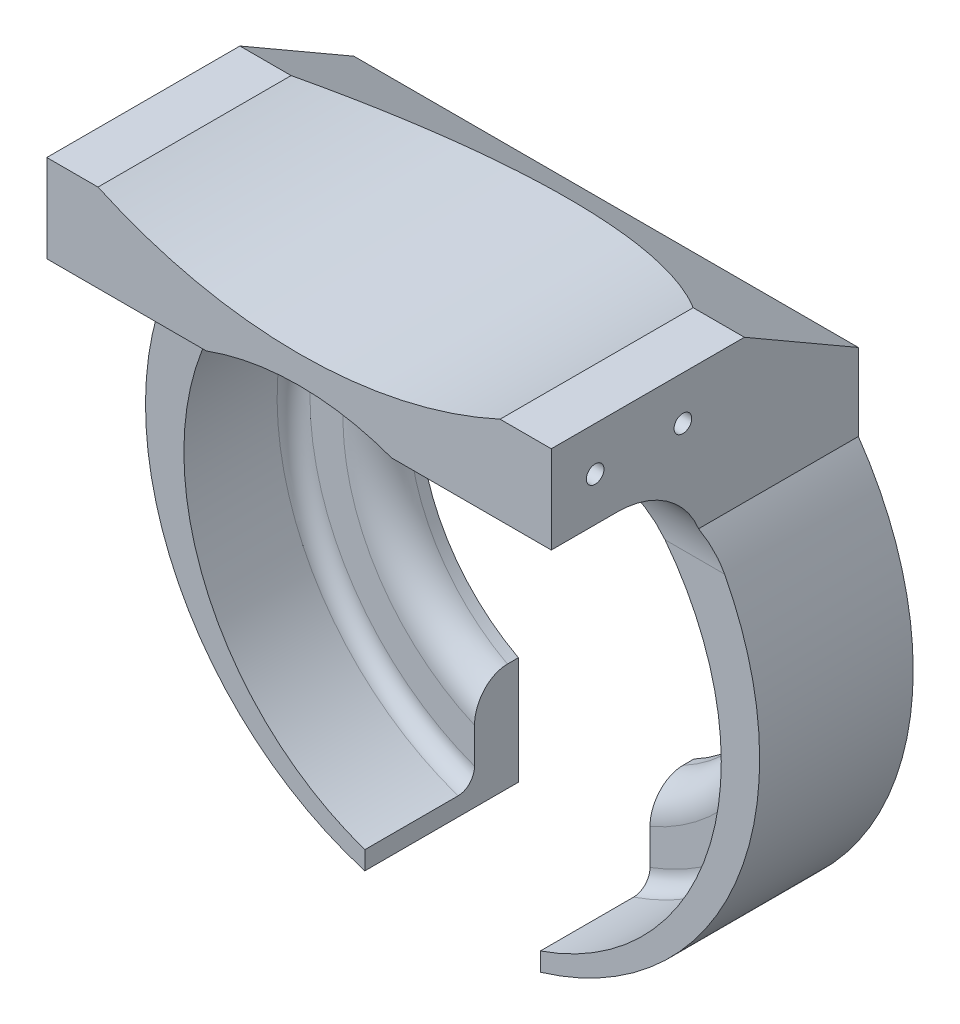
ISO-10303-21;
HEADER;
FILE_DESCRIPTION(('STEP AP214'),'2;1');
FILE_NAME('part.step','',(''),(''),'','','');
FILE_SCHEMA(('AUTOMOTIVE_DESIGN { 1 0 10303 214 1 1 1 1 }'));
ENDSEC;
DATA;
#1=APPLICATION_CONTEXT('core data for automotive mechanical design processes');
#2=APPLICATION_PROTOCOL_DEFINITION('international standard','automotive_design',2000,#1);
#3=PRODUCT_CONTEXT('',#1,'mechanical');
#4=PRODUCT('Part','Part','',(#3));
#5=PRODUCT_RELATED_PRODUCT_CATEGORY('part','',(#4));
#6=PRODUCT_DEFINITION_FORMATION('','',#4);
#7=PRODUCT_DEFINITION_CONTEXT('part definition',#1,'design');
#8=PRODUCT_DEFINITION('design','',#6,#7);
#9=PRODUCT_DEFINITION_SHAPE('','',#8);
#10=(LENGTH_UNIT() NAMED_UNIT(*) SI_UNIT(.MILLI.,.METRE.));
#11=(NAMED_UNIT(*) PLANE_ANGLE_UNIT() SI_UNIT($,.RADIAN.));
#12=(NAMED_UNIT(*) SI_UNIT($,.STERADIAN.) SOLID_ANGLE_UNIT());
#13=UNCERTAINTY_MEASURE_WITH_UNIT(LENGTH_MEASURE(1.E-05),#10,'distance_accuracy_value','');
#14=(GEOMETRIC_REPRESENTATION_CONTEXT(3) GLOBAL_UNCERTAINTY_ASSIGNED_CONTEXT((#13)) GLOBAL_UNIT_ASSIGNED_CONTEXT((#10,
#11,#12)) REPRESENTATION_CONTEXT('',''));
#15=CARTESIAN_POINT('',(0.,0.,0.));
#16=DIRECTION('',(0.,0.,1.));
#17=DIRECTION('',(1.,0.,0.));
#18=AXIS2_PLACEMENT_3D('',#15,#16,#17);
#19=CARTESIAN_POINT('',(-73.025,98.425,88.9));
#20=DIRECTION('',(0.,-1.,0.));
#21=DIRECTION('',(0.,0.,-1.));
#22=AXIS2_PLACEMENT_3D('',#19,#20,#21);
#23=PLANE('',#22);
#24=DIRECTION('',(0.,0.,-1.));
#25=VECTOR('',#24,1.);
#26=CARTESIAN_POINT('',(-58.1987113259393,98.425,88.9));
#27=LINE('',#26,#25);
#28=CARTESIAN_POINT('',(-58.1987113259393,98.425,88.9));
#29=VERTEX_POINT('',#28);
#30=CARTESIAN_POINT('',(-58.1987113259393,98.425,32.9955678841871));
#31=VERTEX_POINT('',#30);
#32=EDGE_CURVE('E472',#29,#31,#27,.T.);
#33=ORIENTED_EDGE('',*,*,#32,.T.);
#34=DIRECTION('',(-1.,0.,0.));
#35=VECTOR('',#34,1.);
#36=CARTESIAN_POINT('',(-73.025,98.425,32.9955678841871));
#37=LINE('',#36,#35);
#38=CARTESIAN_POINT('',(-73.025,98.425,32.9955678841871));
#39=VERTEX_POINT('',#38);
#40=EDGE_CURVE('E304',#31,#39,#37,.T.);
#41=ORIENTED_EDGE('',*,*,#40,.T.);
#42=DIRECTION('',(0.,0.,-1.));
#43=VECTOR('',#42,1.);
#44=CARTESIAN_POINT('',(-73.025,98.425,88.9));
#45=LINE('',#44,#43);
#46=CARTESIAN_POINT('',(-73.025,98.425,88.9));
#47=VERTEX_POINT('',#46);
#48=EDGE_CURVE('E452',#47,#39,#45,.T.);
#49=ORIENTED_EDGE('',*,*,#48,.F.);
#50=DIRECTION('',(-1.,0.,0.));
#51=VECTOR('',#50,1.);
#52=CARTESIAN_POINT('',(-73.025,98.425,88.9));
#53=LINE('',#52,#51);
#54=EDGE_CURVE('E561',#29,#47,#53,.T.);
#55=ORIENTED_EDGE('',*,*,#54,.F.);
#56=EDGE_LOOP('',(#33,#41,#49,#55));
#57=FACE_BOUND('',#56,.T.);
#58=ADVANCED_FACE('F39',(#57),#23,.F.);
#59=CARTESIAN_POINT('',(0.,6.34999999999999,88.9));
#60=DIRECTION('',(0.,0.,-1.));
#61=DIRECTION('',(-1.,0.,0.));
#62=AXIS2_PLACEMENT_3D('',#59,#60,#61);
#63=CYLINDRICAL_SURFACE('',#62,88.9);
#64=DIRECTION('',(0.,0.,-1.));
#65=VECTOR('',#64,1.);
#66=CARTESIAN_POINT('',(-25.4,-78.844189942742,88.9));
#67=LINE('',#66,#65);
#68=CARTESIAN_POINT('',(-25.4,-78.844189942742,0.));
#69=VERTEX_POINT('',#68);
#70=CARTESIAN_POINT('',(-25.4,-78.844189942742,44.45));
#71=VERTEX_POINT('',#70);
#72=EDGE_CURVE('E592',#69,#71,#67,.F.);
#73=ORIENTED_EDGE('',*,*,#72,.T.);
#74=CARTESIAN_POINT('',(0.,6.34999999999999,44.45));
#75=DIRECTION('',(0.,0.,-1.));
#76=DIRECTION('',(-1.,0.,0.));
#77=AXIS2_PLACEMENT_3D('',#74,#75,#76);
#78=CIRCLE('',#77,88.9);
#79=CARTESIAN_POINT('',(-78.7374394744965,47.625,44.45));
#80=VERTEX_POINT('',#79);
#81=EDGE_CURVE('E657',#71,#80,#78,.T.);
#82=ORIENTED_EDGE('',*,*,#81,.T.);
#83=CARTESIAN_POINT('',(-78.7374394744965,47.625,44.45));
#84=CARTESIAN_POINT('',(-78.5194847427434,48.0407895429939,44.450002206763));
#85=CARTESIAN_POINT('',(-78.2982605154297,48.4547798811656,44.4602097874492));
#86=CARTESIAN_POINT('',(-77.8497310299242,49.2784179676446,44.5005181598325));
#87=CARTESIAN_POINT('',(-77.6224264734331,49.6880662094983,44.530616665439));
#88=CARTESIAN_POINT('',(-76.9353783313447,50.9035527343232,44.6493924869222));
#89=CARTESIAN_POINT('',(-76.4672905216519,51.7020505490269,44.766567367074));
#90=CARTESIAN_POINT('',(-75.5130579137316,53.2736975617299,45.0731295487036));
#91=CARTESIAN_POINT('',(-75.0269157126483,54.0468503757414,45.2625064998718));
#92=CARTESIAN_POINT('',(-74.2855609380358,55.1872123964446,45.598575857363));
#93=CARTESIAN_POINT('',(-74.035478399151,55.565457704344,45.7198082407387));
#94=CARTESIAN_POINT('',(-73.532344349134,56.3140648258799,45.9791607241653));
#95=CARTESIAN_POINT('',(-73.2792930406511,56.684427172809,46.1172796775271));
#96=CARTESIAN_POINT('',(-73.025,57.0506841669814,46.2636378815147));
#97=B_SPLINE_CURVE_WITH_KNOTS('',3,(#83,#84,#85,#86,#87,#88,#89,#90,#91,#92,#93,#94,#95,#96),
.UNSPECIFIED.,.F.,.F.,(4,2,2,2,2,2,4),(0.,1.40809209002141,2.81602237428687,5.61123230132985,
8.40604168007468,9.81382127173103,11.2215053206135),.UNSPECIFIED.);
#98=CARTESIAN_POINT('',(-73.025,57.0506841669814,46.2636378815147));
#99=VERTEX_POINT('',#98);
#100=EDGE_CURVE('E515',#80,#99,#97,.T.);
#101=ORIENTED_EDGE('',*,*,#100,.T.);
#102=DIRECTION('',(0.,0.,-1.));
#103=VECTOR('',#102,1.);
#104=CARTESIAN_POINT('',(-73.025,57.0506841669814,88.9));
#105=LINE('',#104,#103);
#106=CARTESIAN_POINT('',(-73.025,57.0506841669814,0.));
#107=VERTEX_POINT('',#106);
#108=EDGE_CURVE('E563',#99,#107,#105,.T.);
#109=ORIENTED_EDGE('',*,*,#108,.T.);
#110=CARTESIAN_POINT('',(0.,6.34999999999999,0.));
#111=DIRECTION('',(0.,0.,1.));
#112=DIRECTION('',(1.,0.,0.));
#113=AXIS2_PLACEMENT_3D('',#110,#111,#112);
#114=CIRCLE('',#113,88.9);
#115=EDGE_CURVE('E557',#107,#69,#114,.T.);
#116=ORIENTED_EDGE('',*,*,#115,.T.);
#117=EDGE_LOOP('',(#73,#82,#101,#109,#116));
#118=FACE_BOUND('',#117,.T.);
#119=ADVANCED_FACE('F243',(#118),#63,.T.);
#120=CARTESIAN_POINT('',(0.,0.,88.9));
#121=DIRECTION('',(0.,0.,-1.));
#122=DIRECTION('',(-1.,0.,0.));
#123=AXIS2_PLACEMENT_3D('',#120,#121,#122);
#124=CYLINDRICAL_SURFACE('',#123,77.7875);
#125=DIRECTION('',(0.,0.,-1.));
#126=VECTOR('',#125,1.);
#127=CARTESIAN_POINT('',(-43.5569441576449,64.4491099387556,10.668));
#128=LINE('',#127,#126);
#129=CARTESIAN_POINT('',(-43.5569441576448,64.4491099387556,17.4625));
#130=VERTEX_POINT('',#129);
#131=CARTESIAN_POINT('',(-43.5569441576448,64.4491099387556,21.336));
#132=VERTEX_POINT('',#131);
#133=EDGE_CURVE('E53',#130,#132,#128,.F.);
#134=ORIENTED_EDGE('',*,*,#133,.F.);
#135=CARTESIAN_POINT('',(0.,0.,17.4625));
#136=DIRECTION('',(0.,0.,-1.));
#137=DIRECTION('',(-1.,0.,0.));
#138=AXIS2_PLACEMENT_3D('',#135,#136,#137);
#139=CIRCLE('',#138,77.7875);
#140=CARTESIAN_POINT('',(43.5569441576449,64.4491099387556,17.4625));
#141=VERTEX_POINT('',#140);
#142=EDGE_CURVE('E445',#130,#141,#139,.T.);
#143=ORIENTED_EDGE('',*,*,#142,.T.);
#144=DIRECTION('',(0.,0.,-1.));
#145=VECTOR('',#144,1.);
#146=CARTESIAN_POINT('',(43.5569441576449,64.4491099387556,10.668));
#147=LINE('',#146,#145);
#148=CARTESIAN_POINT('',(43.5569441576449,64.4491099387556,21.336));
#149=VERTEX_POINT('',#148);
#150=EDGE_CURVE('E315',#149,#141,#147,.T.);
#151=ORIENTED_EDGE('',*,*,#150,.F.);
#152=CARTESIAN_POINT('',(46.3739495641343,62.4527978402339,21.3357999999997));
#153=CARTESIAN_POINT('',(46.2639690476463,62.5344631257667,21.4180951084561));
#154=CARTESIAN_POINT('',(46.1537757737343,62.6158358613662,21.5003964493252));
#155=CARTESIAN_POINT('',(45.9329444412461,62.7780100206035,21.6649857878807));
#156=CARTESIAN_POINT('',(45.822306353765,62.8588114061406,21.7472737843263));
#157=CARTESIAN_POINT('',(45.652832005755,62.9818968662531,21.8730279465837));
#158=CARTESIAN_POINT('',(45.5941576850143,63.0243856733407,21.9165121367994));
#159=CARTESIAN_POINT('',(45.4766787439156,63.1092076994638,22.0034491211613));
#160=CARTESIAN_POINT('',(45.4178741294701,63.1515409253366,22.0469019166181));
#161=CARTESIAN_POINT('',(45.328204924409,63.2159032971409,22.1129879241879));
#162=CARTESIAN_POINT('',(45.2974015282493,63.2379791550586,22.1356588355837));
#163=CARTESIAN_POINT('',(45.2357344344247,63.282105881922,22.1809429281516));
#164=CARTESIAN_POINT('',(45.20487073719,63.3041567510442,22.2035561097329));
#165=CARTESIAN_POINT('',(45.157802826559,63.3377327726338,22.2378163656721));
#166=CARTESIAN_POINT('',(45.1416455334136,63.3492493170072,22.2495368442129));
#167=CARTESIAN_POINT('',(45.1092707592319,63.372306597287,22.2728614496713));
#168=CARTESIAN_POINT('',(45.0930532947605,63.3838473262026,22.2844656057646));
#169=CARTESIAN_POINT('',(45.0681398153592,63.4015618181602,22.3018955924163));
#170=CARTESIAN_POINT('',(45.0595111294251,63.4076945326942,22.3078606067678));
#171=CARTESIAN_POINT('',(45.0421483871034,63.4200294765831,22.3195596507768));
#172=CARTESIAN_POINT('',(45.0334143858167,63.4262316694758,22.3252937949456));
#173=CARTESIAN_POINT('',(45.0196514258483,63.4360006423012,22.3336292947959));
#174=CARTESIAN_POINT('',(45.0147241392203,63.4394971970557,22.3364790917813));
#175=CARTESIAN_POINT('',(45.0046945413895,63.4466127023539,22.3417141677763));
#176=CARTESIAN_POINT('',(44.9995922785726,63.4502316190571,22.3440995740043));
#177=CARTESIAN_POINT('',(44.990854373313,63.4564275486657,22.3471483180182));
#178=CARTESIAN_POINT('',(44.9872969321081,63.4589496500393,22.3481206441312));
#179=CARTESIAN_POINT('',(44.9801129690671,63.4640418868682,22.3492479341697));
#180=CARTESIAN_POINT('',(44.9764871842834,63.4666115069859,22.3494090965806));
#181=CARTESIAN_POINT('',(44.969292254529,63.4717096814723,22.3488594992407));
#182=CARTESIAN_POINT('',(44.9657230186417,63.474238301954,22.3481503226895));
#183=CARTESIAN_POINT('',(44.9586780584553,63.4792284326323,22.3461227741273));
#184=CARTESIAN_POINT('',(44.9552035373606,63.4816890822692,22.3447987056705));
#185=CARTESIAN_POINT('',(44.9477383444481,63.4869750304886,22.3415328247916));
#186=CARTESIAN_POINT('',(44.9437684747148,63.4897854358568,22.3395225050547));
#187=CARTESIAN_POINT('',(44.9359186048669,63.4953415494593,22.3352488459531));
#188=CARTESIAN_POINT('',(44.9320386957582,63.4980871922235,22.332985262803));
#189=CARTESIAN_POINT('',(44.9204616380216,63.506278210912,22.3259784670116));
#190=CARTESIAN_POINT('',(44.9128476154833,63.5116631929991,22.3210298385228));
#191=CARTESIAN_POINT('',(44.8976923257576,63.5223776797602,22.3109210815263));
#192=CARTESIAN_POINT('',(44.8901512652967,63.5277070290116,22.305760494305));
#193=CARTESIAN_POINT('',(44.8751280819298,63.5383200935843,22.2953442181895));
#194=CARTESIAN_POINT('',(44.8676458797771,63.5436038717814,22.290088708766));
#195=CARTESIAN_POINT('',(44.8453764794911,63.5593242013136,22.274341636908));
#196=CARTESIAN_POINT('',(44.830623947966,63.5697305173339,22.2637714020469));
#197=CARTESIAN_POINT('',(44.8011507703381,63.5905053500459,22.242548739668));
#198=CARTESIAN_POINT('',(44.7864301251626,63.6008738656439,22.2318963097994));
#199=CARTESIAN_POINT('',(44.7422670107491,63.6319573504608,22.1998633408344));
#200=CARTESIAN_POINT('',(44.7128434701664,63.6526360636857,22.1784215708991));
#201=CARTESIAN_POINT('',(44.6541079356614,63.6938543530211,22.1355688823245));
#202=CARTESIAN_POINT('',(44.6247959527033,63.7143941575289,22.1141581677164));
#203=CARTESIAN_POINT('',(44.5661635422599,63.7554194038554,22.0713139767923));
#204=CARTESIAN_POINT('',(44.5368431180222,63.7759048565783,22.0498805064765));
#205=CARTESIAN_POINT('',(44.4289358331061,63.8511863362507,21.9710043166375));
#206=CARTESIAN_POINT('',(44.3502818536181,63.9058434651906,21.9135207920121));
#207=CARTESIAN_POINT('',(44.192778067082,64.0148630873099,21.7985223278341));
#208=CARTESIAN_POINT('',(44.1139282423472,64.0692255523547,21.7410073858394));
#209=CARTESIAN_POINT('',(43.9554569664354,64.1780512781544,21.6255443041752));
#210=CARTESIAN_POINT('',(43.8758340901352,64.2325123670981,21.5675960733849));
#211=CARTESIAN_POINT('',(43.7163970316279,64.3411306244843,21.4516986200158));
#212=CARTESIAN_POINT('',(43.6365828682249,64.3952878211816,21.3937493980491));
#213=CARTESIAN_POINT('',(43.5566683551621,64.4492963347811,21.3357999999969));
#214=B_SPLINE_CURVE_WITH_KNOTS('',3,(#152,#153,#154,#155,#156,#157,#158,#159,#160,#161,#162,
#163,#164,#165,#166,#167,#168,#169,#170,#171,#172,#173,#174,#175,#176,#177,#178,#179,#180,#181,
#182,#183,#184,#185,#186,#187,#188,#189,#190,#191,#192,#193,#194,#195,#196,#197,#198,#199,#200,
#201,#202,#203,#204,#205,#206,#207,#208,#209,#210,#211,#212,#213),.UNSPECIFIED.,.F.,.F.,(4,2,2,
2,2,2,2,2,2,2,2,2,2,2,2,2,2,2,2,2,2,2,2,2,2,2,2,2,2,2,4),(0.,0.479412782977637,
0.958857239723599,1.2123322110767,1.46579590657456,1.59827798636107,1.73075912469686,
1.79989382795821,1.86901073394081,1.90546491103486,1.94190077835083,1.96193782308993,
1.98196937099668,1.99532211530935,2.00857266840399,2.02179915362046,2.03515069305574,
2.05092598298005,2.06671659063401,2.09837932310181,2.13011461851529,2.16179515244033,
2.2245555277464,2.28731770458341,2.41292767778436,2.53804941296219,2.66314379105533,
2.99826082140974,3.33340930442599,3.67100951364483,4.00857779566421),.UNSPECIFIED.);
#215=CARTESIAN_POINT('',(46.3736823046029,62.4529962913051,21.336));
#216=VERTEX_POINT('',#215);
#217=EDGE_CURVE('E308',#216,#149,#214,.T.);
#218=ORIENTED_EDGE('',*,*,#217,.F.);
#219=DIRECTION('',(0.,0.,-1.));
#220=VECTOR('',#219,1.);
#221=CARTESIAN_POINT('',(46.3736823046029,62.4529962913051,10.668));
#222=LINE('',#221,#220);
#223=CARTESIAN_POINT('',(46.3736823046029,62.4529962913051,17.4625));
#224=VERTEX_POINT('',#223);
#225=EDGE_CURVE('E427',#224,#216,#222,.F.);
#226=ORIENTED_EDGE('',*,*,#225,.F.);
#227=CARTESIAN_POINT('',(25.4,-73.5237047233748,17.4625));
#228=VERTEX_POINT('',#227);
#229=EDGE_CURVE('E449',#224,#228,#139,.T.);
#230=ORIENTED_EDGE('',*,*,#229,.T.);
#231=DIRECTION('',(0.,0.,-1.));
#232=VECTOR('',#231,1.);
#233=CARTESIAN_POINT('',(25.4,-73.5237047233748,88.9));
#234=LINE('',#233,#232);
#235=CARTESIAN_POINT('',(25.4,-73.5237047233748,44.45));
#236=VERTEX_POINT('',#235);
#237=EDGE_CURVE('E397',#236,#228,#234,.T.);
#238=ORIENTED_EDGE('',*,*,#237,.F.);
#239=CARTESIAN_POINT('',(0.,0.,44.45));
#240=DIRECTION('',(0.,0.,-1.));
#241=DIRECTION('',(-1.,0.,0.));
#242=AXIS2_PLACEMENT_3D('',#239,#240,#241);
#243=CIRCLE('',#242,77.7875);
#244=CARTESIAN_POINT('',(61.5041017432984,47.625,44.45));
#245=VERTEX_POINT('',#244);
#246=EDGE_CURVE('E644',#245,#236,#243,.T.);
#247=ORIENTED_EDGE('',*,*,#246,.F.);
#248=CARTESIAN_POINT('',(61.5041017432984,47.625,44.45));
#249=CARTESIAN_POINT('',(61.173431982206,48.0520534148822,44.4500041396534));
#250=CARTESIAN_POINT('',(60.8383252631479,48.4756128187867,44.4607695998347));
#251=CARTESIAN_POINT('',(60.1599400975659,49.314981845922,44.5027999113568));
#252=CARTESIAN_POINT('',(59.816663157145,49.7307928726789,44.5340610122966));
#253=CARTESIAN_POINT('',(59.1229663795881,50.553528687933,44.6160071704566));
#254=CARTESIAN_POINT('',(58.7725563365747,50.9604642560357,44.6666670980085));
#255=CARTESIAN_POINT('',(58.0647821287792,51.7654670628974,44.7864379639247));
#256=CARTESIAN_POINT('',(57.7074176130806,52.1635338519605,44.8555498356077));
#257=CARTESIAN_POINT('',(56.6288508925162,53.3403877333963,45.0884938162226));
#258=CARTESIAN_POINT('',(55.8981117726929,54.1054573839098,45.278312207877));
#259=CARTESIAN_POINT('',(54.4154905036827,55.5963647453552,45.7207141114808));
#260=CARTESIAN_POINT('',(53.6635987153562,56.3221841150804,45.9733266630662));
#261=CARTESIAN_POINT('',(52.3749266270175,57.517666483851,46.4497112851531));
#262=CARTESIAN_POINT('',(51.8424702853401,57.9979468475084,46.6587864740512));
#263=CARTESIAN_POINT('',(50.7706271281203,58.9385011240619,47.1027985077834));
#264=CARTESIAN_POINT('',(50.2312397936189,59.3987735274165,47.3377372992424));
#265=CARTESIAN_POINT('',(49.1466719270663,60.2992268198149,47.8321012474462));
#266=CARTESIAN_POINT('',(48.6014897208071,60.739401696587,48.0915336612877));
#267=CARTESIAN_POINT('',(47.5067235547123,61.5994390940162,48.6336515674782));
#268=CARTESIAN_POINT('',(46.9571397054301,62.0193021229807,48.916336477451));
#269=CARTESIAN_POINT('',(45.8534195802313,62.8397412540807,49.5048002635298));
#270=CARTESIAN_POINT('',(45.2992753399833,63.2402662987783,49.8106353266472));
#271=CARTESIAN_POINT('',(44.189102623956,64.020925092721,50.4441669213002));
#272=CARTESIAN_POINT('',(43.6330740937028,64.4010582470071,50.771864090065));
#273=CARTESIAN_POINT('',(42.5208114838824,65.1407829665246,51.4486798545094));
#274=CARTESIAN_POINT('',(41.9645775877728,65.5003830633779,51.7977894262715));
#275=CARTESIAN_POINT('',(40.8533498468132,66.1991671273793,52.5176052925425));
#276=CARTESIAN_POINT('',(40.2983559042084,66.5383527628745,52.8883098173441));
#277=CARTESIAN_POINT('',(39.1116955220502,67.2436823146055,53.7068931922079));
#278=CARTESIAN_POINT('',(38.4805043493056,67.606668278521,54.1581954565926));
#279=CARTESIAN_POINT('',(37.2258152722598,68.3055599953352,55.091464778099));
#280=CARTESIAN_POINT('',(36.6023174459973,68.6414654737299,55.573432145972));
#281=CARTESIAN_POINT('',(35.3691303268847,69.2849327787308,56.5699891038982));
#282=CARTESIAN_POINT('',(34.7594150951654,69.592551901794,57.0845090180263));
#283=CARTESIAN_POINT('',(33.8598175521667,70.0322753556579,57.884783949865));
#284=CARTESIAN_POINT('',(33.5624754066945,70.175219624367,58.1562640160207));
#285=CARTESIAN_POINT('',(32.9740099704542,70.4536420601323,58.7095749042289));
#286=CARTESIAN_POINT('',(32.6828861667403,70.5891208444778,58.9914048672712));
#287=CARTESIAN_POINT('',(32.0703814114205,70.8696954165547,59.6043999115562));
#288=CARTESIAN_POINT('',(31.7500888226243,71.0136945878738,59.9371613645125));
#289=CARTESIAN_POINT('',(31.1223827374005,71.2910240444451,60.6188198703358));
#290=CARTESIAN_POINT('',(30.8149664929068,71.4243566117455,60.9677134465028));
#291=CARTESIAN_POINT('',(30.2167495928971,71.6794876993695,61.6838383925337));
#292=CARTESIAN_POINT('',(29.9259553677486,71.8012817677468,62.0510767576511));
#293=CARTESIAN_POINT('',(29.3665054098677,72.0319018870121,62.8059361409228));
#294=CARTESIAN_POINT('',(29.0978409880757,72.1407330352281,63.1935490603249));
#295=CARTESIAN_POINT('',(28.6776795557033,72.3084920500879,63.8535245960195));
#296=CARTESIAN_POINT('',(28.5177663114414,72.3716723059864,64.1194488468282));
#297=CARTESIAN_POINT('',(28.2131178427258,72.4909778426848,64.661533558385));
#298=CARTESIAN_POINT('',(28.0683856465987,72.5471017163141,64.9376960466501));
#299=CARTESIAN_POINT('',(27.7978205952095,72.6512027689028,65.4991035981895));
#300=CARTESIAN_POINT('',(27.6719056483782,72.6992154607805,65.7843022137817));
#301=CARTESIAN_POINT('',(27.4417002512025,72.7864232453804,66.3644989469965));
#302=CARTESIAN_POINT('',(27.3373955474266,72.8256241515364,66.6594904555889));
#303=CARTESIAN_POINT('',(27.1746612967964,72.8864781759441,67.1906496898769));
#304=CARTESIAN_POINT('',(27.111191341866,72.9100948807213,67.4250498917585));
#305=CARTESIAN_POINT('',(27.0008909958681,72.9510142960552,67.8982358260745));
#306=CARTESIAN_POINT('',(26.9540553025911,72.9683190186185,68.1370201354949));
#307=CARTESIAN_POINT('',(26.8779480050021,72.996389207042,68.6204683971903));
#308=CARTESIAN_POINT('',(26.8488742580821,73.0070810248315,68.865168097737));
#309=CARTESIAN_POINT('',(26.8098781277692,73.0214056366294,69.3565581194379));
#310=CARTESIAN_POINT('',(26.7999770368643,73.0250305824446,69.6032503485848));
#311=CARTESIAN_POINT('',(26.800084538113,73.025,69.85));
#312=B_SPLINE_CURVE_WITH_KNOTS('',3,(#248,#249,#250,#251,#252,#253,#254,#255,#256,#257,#258,
#259,#260,#261,#262,#263,#264,#265,#266,#267,#268,#269,#270,#271,#272,#273,#274,#275,#276,#277,
#278,#279,#280,#281,#282,#283,#284,#285,#286,#287,#288,#289,#290,#291,#292,#293,#294,#295,#296,
#297,#298,#299,#300,#301,#302,#303,#304,#305,#306,#307,#308,#309,#310,#311),.UNSPECIFIED.,.F.,
.F.,(4,2,2,2,2,2,2,2,2,2,2,2,2,2,2,2,2,2,2,2,2,2,2,2,2,2,2,2,2,2,2,4),(0.,1.62011987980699,
3.239943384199,4.85767559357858,6.47548964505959,9.69686421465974,12.9197313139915,
15.159779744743,17.3999968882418,19.6408798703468,21.8817067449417,24.1281583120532,
26.3746753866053,28.620252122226,30.8656450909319,33.4345838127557,36.0035485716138,
38.5671894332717,39.8487638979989,41.1302322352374,42.5811225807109,44.0317016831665,
45.4828382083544,46.9334022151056,47.8829114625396,48.8326097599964,49.7780357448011,
50.7228361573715,51.4541787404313,52.1852879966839,52.9243995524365,53.664331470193),.UNSPECIFIED.);
#313=CARTESIAN_POINT('',(26.8000845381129,73.025,69.85));
#314=VERTEX_POINT('',#313);
#315=EDGE_CURVE('E495',#245,#314,#312,.T.);
#316=ORIENTED_EDGE('',*,*,#315,.T.);
#317=DIRECTION('',(0.,0.,-1.));
#318=VECTOR('',#317,1.);
#319=CARTESIAN_POINT('',(26.8000845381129,73.025,88.9));
#320=LINE('',#319,#318);
#321=CARTESIAN_POINT('',(26.8000845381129,73.025,88.9));
#322=VERTEX_POINT('',#321);
#323=EDGE_CURVE('E602',#322,#314,#320,.T.);
#324=ORIENTED_EDGE('',*,*,#323,.F.);
#325=CARTESIAN_POINT('',(0.,0.,88.9));
#326=DIRECTION('',(0.,0.,1.));
#327=DIRECTION('',(1.,0.,0.));
#328=AXIS2_PLACEMENT_3D('',#325,#326,#327);
#329=CIRCLE('',#328,77.7875);
#330=CARTESIAN_POINT('',(-26.8000845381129,73.025,88.9));
#331=VERTEX_POINT('',#330);
#332=EDGE_CURVE('E539',#322,#331,#329,.T.);
#333=ORIENTED_EDGE('',*,*,#332,.T.);
#334=DIRECTION('',(0.,0.,-1.));
#335=VECTOR('',#334,1.);
#336=CARTESIAN_POINT('',(-26.8000845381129,73.025,88.9));
#337=LINE('',#336,#335);
#338=CARTESIAN_POINT('',(-26.8000845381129,73.025,69.85));
#339=VERTEX_POINT('',#338);
#340=EDGE_CURVE('E607',#339,#331,#337,.F.);
#341=ORIENTED_EDGE('',*,*,#340,.F.);
#342=CARTESIAN_POINT('',(-26.8000845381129,73.025,69.85));
#343=CARTESIAN_POINT('',(-26.8000750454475,73.0250025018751,69.700384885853));
#344=CARTESIAN_POINT('',(-26.8036882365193,73.0236775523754,69.5507969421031));
#345=CARTESIAN_POINT('',(-26.8180645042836,73.0183994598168,69.2520337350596));
#346=CARTESIAN_POINT('',(-26.8288264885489,73.0144467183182,69.102858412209));
#347=CARTESIAN_POINT('',(-26.8716267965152,72.9987109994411,68.6571213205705));
#348=CARTESIAN_POINT('',(-26.914180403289,72.9830502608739,68.361640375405));
#349=CARTESIAN_POINT('',(-27.0244713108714,72.9422816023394,67.7815684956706));
#350=CARTESIAN_POINT('',(-27.0917563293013,72.9173432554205,67.4968775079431));
#351=CARTESIAN_POINT('',(-27.2490168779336,72.8587212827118,66.9346500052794));
#352=CARTESIAN_POINT('',(-27.3390053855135,72.825032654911,66.6571176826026));
#353=CARTESIAN_POINT('',(-27.5739553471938,72.7364620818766,66.0141601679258));
#354=CARTESIAN_POINT('',(-27.7271170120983,72.67829434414,65.6521882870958));
#355=CARTESIAN_POINT('',(-28.0626632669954,72.5493925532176,64.9444709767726));
#356=CARTESIAN_POINT('',(-28.245059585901,72.4786534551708,64.5987321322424));
#357=CARTESIAN_POINT('',(-28.6345625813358,72.3256600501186,63.920479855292));
#358=CARTESIAN_POINT('',(-28.8418536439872,72.2433189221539,63.5880929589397));
#359=CARTESIAN_POINT('',(-29.2749862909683,72.0688896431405,62.9384606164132));
#360=CARTESIAN_POINT('',(-29.5008265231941,71.9768022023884,62.6212140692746));
#361=CARTESIAN_POINT('',(-29.9691289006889,71.7830845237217,61.9979737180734));
#362=CARTESIAN_POINT('',(-30.211713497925,71.6813813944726,61.692095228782));
#363=CARTESIAN_POINT('',(-30.7087938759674,71.4698407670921,61.0930321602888));
#364=CARTESIAN_POINT('',(-30.9632923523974,71.3600014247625,60.7998504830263));
#365=CARTESIAN_POINT('',(-31.481963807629,71.1327022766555,60.2248463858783));
#366=CARTESIAN_POINT('',(-31.7461437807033,71.0152369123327,59.9430325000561));
#367=CARTESIAN_POINT('',(-32.2821781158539,70.7731780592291,59.3899369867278));
#368=CARTESIAN_POINT('',(-32.554033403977,70.6485837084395,59.1186566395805));
#369=CARTESIAN_POINT('',(-33.3796413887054,70.2642367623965,58.3184768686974));
#370=CARTESIAN_POINT('',(-33.9426985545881,69.9942415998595,57.8040413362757));
#371=CARTESIAN_POINT('',(-35.0847078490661,69.4288475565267,56.8085475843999));
#372=CARTESIAN_POINT('',(-35.6636553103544,69.133456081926,56.3274797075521));
#373=CARTESIAN_POINT('',(-36.8054664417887,68.5321093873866,55.4161173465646));
#374=CARTESIAN_POINT('',(-37.3678604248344,68.2272493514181,54.9845080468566));
#375=CARTESIAN_POINT('',(-38.4988289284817,67.5955251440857,54.1460632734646));
#376=CARTESIAN_POINT('',(-39.067404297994,67.2686579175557,53.7392312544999));
#377=CARTESIAN_POINT('',(-40.2083476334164,66.5929713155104,52.9489210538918));
#378=CARTESIAN_POINT('',(-40.7807176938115,66.2441387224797,52.5654572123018));
#379=CARTESIAN_POINT('',(-41.9267533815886,65.5248062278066,51.821561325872));
#380=CARTESIAN_POINT('',(-42.5004189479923,65.1543073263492,51.461128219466));
#381=CARTESIAN_POINT('',(-43.6458505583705,64.392598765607,50.7640504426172));
#382=CARTESIAN_POINT('',(-44.2176177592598,64.0014433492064,50.4273484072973));
#383=CARTESIAN_POINT('',(-45.3591457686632,63.1975505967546,49.7770596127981));
#384=CARTESIAN_POINT('',(-45.9289065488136,62.7848129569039,49.4634731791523));
#385=CARTESIAN_POINT('',(-47.0649098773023,61.9378021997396,48.8601452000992));
#386=CARTESIAN_POINT('',(-47.6311528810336,61.5035319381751,48.5704005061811));
#387=CARTESIAN_POINT('',(-48.7588288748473,60.6134285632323,48.0157219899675));
#388=CARTESIAN_POINT('',(-49.3202619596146,60.1575958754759,47.7507876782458));
#389=CARTESIAN_POINT('',(-50.394859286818,59.2596483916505,47.2660398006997));
#390=CARTESIAN_POINT('',(-50.9084703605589,58.8190919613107,47.0443302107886));
#391=CARTESIAN_POINT('',(-51.9294248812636,57.9197101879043,46.6244696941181));
#392=CARTESIAN_POINT('',(-52.4367676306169,57.4608828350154,46.4263213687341));
#393=CARTESIAN_POINT('',(-53.4436985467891,56.5255527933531,46.0551867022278));
#394=CARTESIAN_POINT('',(-53.9432914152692,56.0490614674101,45.8821845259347));
#395=CARTESIAN_POINT('',(-54.9338774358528,55.0785351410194,45.5628475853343));
#396=CARTESIAN_POINT('',(-55.4248709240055,54.5845008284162,45.4165117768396));
#397=CARTESIAN_POINT('',(-56.3999881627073,53.5764049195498,45.1515381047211));
#398=CARTESIAN_POINT('',(-56.8840528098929,53.0622407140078,45.0330721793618));
#399=CARTESIAN_POINT('',(-57.840906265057,52.0175593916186,44.827033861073));
#400=CARTESIAN_POINT('',(-58.3136962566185,51.4870440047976,44.7394582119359));
#401=CARTESIAN_POINT('',(-59.2477385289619,50.4094214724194,44.5972168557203));
#402=CARTESIAN_POINT('',(-59.7089619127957,49.8622791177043,44.5426269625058));
#403=CARTESIAN_POINT('',(-60.6174368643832,48.7538371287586,44.4690187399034));
#404=CARTESIAN_POINT('',(-61.0646828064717,48.1925319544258,44.4500145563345));
#405=CARTESIAN_POINT('',(-61.5041017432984,47.625,44.45));
#406=B_SPLINE_CURVE_WITH_KNOTS('',3,(#342,#343,#344,#345,#346,#347,#348,#349,#350,#351,#352,
#353,#354,#355,#356,#357,#358,#359,#360,#361,#362,#363,#364,#365,#366,#367,#368,#369,#370,#371,
#372,#373,#374,#375,#376,#377,#378,#379,#380,#381,#382,#383,#384,#385,#386,#387,#388,#389,#390,
#391,#392,#393,#394,#395,#396,#397,#398,#399,#400,#401,#402,#403,#404,#405),.UNSPECIFIED.,.F.,
.F.,(4,2,2,2,2,2,2,2,2,2,2,2,2,2,2,2,2,2,2,2,2,2,2,2,2,2,2,2,2,2,2,4),(0.,0.448743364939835,
0.897418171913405,1.79265356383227,2.67227148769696,3.55239334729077,4.74235278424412,
5.93279083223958,7.13266375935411,8.3324493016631,9.54219755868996,10.7522208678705,
11.9631362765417,13.1741984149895,15.5997249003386,18.0245464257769,20.3388444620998,
22.6534644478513,24.9694908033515,27.2854103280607,29.5955246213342,31.9056714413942,
34.2155126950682,36.525308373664,38.6608945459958,40.7967162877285,42.9311871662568,
45.065574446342,47.2128030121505,49.3598051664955,51.5117233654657,53.6644968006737),.UNSPECIFIED.);
#407=CARTESIAN_POINT('',(-61.5041017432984,47.625,44.45));
#408=VERTEX_POINT('',#407);
#409=EDGE_CURVE('E289',#339,#408,#406,.T.);
#410=ORIENTED_EDGE('',*,*,#409,.T.);
#411=CARTESIAN_POINT('',(-25.4,-73.5237047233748,44.45));
#412=VERTEX_POINT('',#411);
#413=EDGE_CURVE('E542',#412,#408,#243,.T.);
#414=ORIENTED_EDGE('',*,*,#413,.F.);
#415=DIRECTION('',(0.,0.,-1.));
#416=VECTOR('',#415,1.);
#417=CARTESIAN_POINT('',(-25.4,-73.5237047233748,88.9));
#418=LINE('',#417,#416);
#419=CARTESIAN_POINT('',(-25.4,-73.5237047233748,17.4625));
#420=VERTEX_POINT('',#419);
#421=EDGE_CURVE('E596',#420,#412,#418,.F.);
#422=ORIENTED_EDGE('',*,*,#421,.F.);
#423=CARTESIAN_POINT('',(-46.3736823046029,62.4529962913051,17.4625));
#424=VERTEX_POINT('',#423);
#425=EDGE_CURVE('E443',#420,#424,#139,.T.);
#426=ORIENTED_EDGE('',*,*,#425,.T.);
#427=DIRECTION('',(0.,0.,-1.));
#428=VECTOR('',#427,1.);
#429=CARTESIAN_POINT('',(-46.3736823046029,62.4529962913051,10.668));
#430=LINE('',#429,#428);
#431=CARTESIAN_POINT('',(-46.3736823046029,62.4529962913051,21.336));
#432=VERTEX_POINT('',#431);
#433=EDGE_CURVE('E433',#432,#424,#430,.T.);
#434=ORIENTED_EDGE('',*,*,#433,.F.);
#435=CARTESIAN_POINT('',(-43.556668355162,64.4492963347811,21.3357999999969));
#436=CARTESIAN_POINT('',(-43.6701646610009,64.3725922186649,21.4180951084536));
#437=CARTESIAN_POINT('',(-43.7834554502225,64.2955904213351,21.5003964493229));
#438=CARTESIAN_POINT('',(-44.0096453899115,64.1409778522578,21.6649857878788));
#439=CARTESIAN_POINT('',(-44.1225445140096,64.0633670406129,21.7472737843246));
#440=CARTESIAN_POINT('',(-44.2948357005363,63.9442564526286,21.8730279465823));
#441=CARTESIAN_POINT('',(-44.3543672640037,63.9029773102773,21.9165121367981));
#442=CARTESIAN_POINT('',(-44.4733267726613,63.8202445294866,22.0034491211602));
#443=CARTESIAN_POINT('',(-44.532754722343,63.7787908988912,22.0469019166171));
#444=CARTESIAN_POINT('',(-44.6231950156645,63.7155166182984,22.1129879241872));
#445=CARTESIAN_POINT('',(-44.6542311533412,63.693769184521,22.135658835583));
#446=CARTESIAN_POINT('',(-44.7162998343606,63.65020914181,22.1809429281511));
#447=CARTESIAN_POINT('',(-44.7473323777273,63.6283965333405,22.2035561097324));
#448=CARTESIAN_POINT('',(-44.7946086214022,63.5951144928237,22.2378163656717));
#449=CARTESIAN_POINT('',(-44.8108286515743,63.5836864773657,22.2495368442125));
#450=CARTESIAN_POINT('',(-44.8433114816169,63.5607816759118,22.272861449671));
#451=CARTESIAN_POINT('',(-44.8595742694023,63.549304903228,22.2844656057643));
#452=CARTESIAN_POINT('',(-44.884543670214,63.5316693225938,22.301895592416));
#453=CARTESIAN_POINT('',(-44.8931892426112,63.5255604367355,22.3078606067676));
#454=CARTESIAN_POINT('',(-44.9105808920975,63.5132662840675,22.3195596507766));
#455=CARTESIAN_POINT('',(-44.9193269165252,63.5070810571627,22.3252937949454));
#456=CARTESIAN_POINT('',(-44.9331046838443,63.4973329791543,22.3336292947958));
#457=CARTESIAN_POINT('',(-44.9380364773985,63.4938427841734,22.3364790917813));
#458=CARTESIAN_POINT('',(-44.9480735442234,63.4867378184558,22.3417141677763));
#459=CARTESIAN_POINT('',(-44.9531787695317,63.483123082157,22.3440995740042));
#460=CARTESIAN_POINT('',(-44.9619201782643,63.476932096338,22.3471483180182));
#461=CARTESIAN_POINT('',(-44.9654786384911,63.4744114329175,22.3481206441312));
#462=CARTESIAN_POINT('',(-44.9726637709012,63.4693208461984,22.3492479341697));
#463=CARTESIAN_POINT('',(-44.9762897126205,63.4667514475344,22.3494090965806));
#464=CARTESIAN_POINT('',(-44.9834840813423,63.4616524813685,22.3488594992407));
#465=CARTESIAN_POINT('',(-44.9870526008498,63.4591228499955,22.3481503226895));
#466=CARTESIAN_POINT('',(-44.9940953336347,63.454129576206,22.3461227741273));
#467=CARTESIAN_POINT('',(-44.9975683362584,63.4516667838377,22.3447987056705));
#468=CARTESIAN_POINT('',(-45.0050294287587,63.4463750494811,22.3415328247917));
#469=CARTESIAN_POINT('',(-45.0089965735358,63.443560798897,22.3395225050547));
#470=CARTESIAN_POINT('',(-45.0168400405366,63.4379956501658,22.3352488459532));
#471=CARTESIAN_POINT('',(-45.0207162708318,63.4352448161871,22.3329852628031));
#472=CARTESIAN_POINT('',(-45.0322808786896,63.4270362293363,22.3259784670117));
#473=CARTESIAN_POINT('',(-45.0398847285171,63.4216368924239,22.3210298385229));
#474=CARTESIAN_POINT('',(-45.0550159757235,63.4108884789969,22.3109210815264));
#475=CARTESIAN_POINT('',(-45.0625431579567,63.4055395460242,22.3057604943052));
#476=CARTESIAN_POINT('',(-45.0775349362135,63.3948821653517,22.2953442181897));
#477=CARTESIAN_POINT('',(-45.0849996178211,63.3895736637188,22.2900887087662));
#478=CARTESIAN_POINT('',(-45.1072113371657,63.3737719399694,22.2743416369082));
#479=CARTESIAN_POINT('',(-45.121918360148,63.3633014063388,22.2637714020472));
#480=CARTESIAN_POINT('',(-45.1512861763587,63.3423778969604,22.2425487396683));
#481=CARTESIAN_POINT('',(-45.1659469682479,63.3319249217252,22.2318963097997));
#482=CARTESIAN_POINT('',(-45.2099089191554,63.3005575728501,22.1998633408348));
#483=CARTESIAN_POINT('',(-45.2391695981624,63.2796490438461,22.1784215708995));
#484=CARTESIAN_POINT('',(-45.2975227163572,63.2378911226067,22.135568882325));
#485=CARTESIAN_POINT('',(-45.3266153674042,63.2170418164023,22.114158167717));
#486=CARTESIAN_POINT('',(-45.3847521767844,63.175317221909,22.0713139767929));
#487=CARTESIAN_POINT('',(-45.4137963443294,63.1544419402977,22.0498805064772));
#488=CARTESIAN_POINT('',(-45.520582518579,63.0775784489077,21.9710043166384));
#489=CARTESIAN_POINT('',(-45.5982157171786,63.0214808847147,21.9135207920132));
#490=CARTESIAN_POINT('',(-45.7532690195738,62.9090033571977,21.7985223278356));
#491=CARTESIAN_POINT('',(-45.8306891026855,62.8526233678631,21.7410073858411));
#492=CARTESIAN_POINT('',(-45.9858800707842,62.7391687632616,21.6255443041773));
#493=CARTESIAN_POINT('',(-46.0636493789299,62.6820920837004,21.5675960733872));
#494=CARTESIAN_POINT('',(-46.2189646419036,62.5676575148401,21.4516986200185));
#495=CARTESIAN_POINT('',(-46.2965106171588,62.5102996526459,21.393749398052));
#496=CARTESIAN_POINT('',(-46.3739495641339,62.4527978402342,21.3358));
#497=B_SPLINE_CURVE_WITH_KNOTS('',3,(#435,#436,#437,#438,#439,#440,#441,#442,#443,#444,#445,
#446,#447,#448,#449,#450,#451,#452,#453,#454,#455,#456,#457,#458,#459,#460,#461,#462,#463,#464,
#465,#466,#467,#468,#469,#470,#471,#472,#473,#474,#475,#476,#477,#478,#479,#480,#481,#482,#483,
#484,#485,#486,#487,#488,#489,#490,#491,#492,#493,#494,#495,#496),.UNSPECIFIED.,.F.,.F.,(4,2,2,
2,2,2,2,2,2,2,2,2,2,2,2,2,2,2,2,2,2,2,2,2,2,2,2,2,2,2,4),(0.,0.479412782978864,
0.958857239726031,1.21233221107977,1.46579590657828,1.59827798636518,1.73075912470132,
1.79989382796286,1.86901073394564,1.90546491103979,1.94190077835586,1.96193782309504,
1.98196937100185,1.99532211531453,2.00857266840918,2.02179915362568,2.03515069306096,
2.05092598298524,2.06671659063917,2.0983793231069,2.13011461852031,2.16179515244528,
2.22455552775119,2.28731770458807,2.41292767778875,2.53804941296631,2.66314379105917,
2.99826082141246,3.33340930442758,3.67100951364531,4.00857779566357),.UNSPECIFIED.);
#498=EDGE_CURVE('E426',#132,#432,#497,.T.);
#499=ORIENTED_EDGE('',*,*,#498,.F.);
#500=EDGE_LOOP('',(#134,#143,#151,#218,#226,#230,#238,#247,#316,#324,#333,#341,#410,#414,#422,
#426,#434,#499));
#501=FACE_BOUND('',#500,.T.);
#502=ADVANCED_FACE('F250',(#501),#124,.F.);
#503=CARTESIAN_POINT('',(0.,6.34999999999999,88.9));
#504=DIRECTION('',(0.,0.,1.));
#505=DIRECTION('',(1.,0.,0.));
#506=AXIS2_PLACEMENT_3D('',#503,#504,#505);
#507=PLANE('',#506);
#508=DIRECTION('',(-1.,0.,0.));
#509=VECTOR('',#508,1.);
#510=CARTESIAN_POINT('',(-101.6,73.025,88.9));
#511=LINE('',#510,#509);
#512=CARTESIAN_POINT('',(73.025,73.025,88.9));
#513=VERTEX_POINT('',#512);
#514=EDGE_CURVE('E536',#513,#322,#511,.T.);
#515=ORIENTED_EDGE('',*,*,#514,.F.);
#516=DIRECTION('',(0.,1.,0.));
#517=VECTOR('',#516,1.);
#518=CARTESIAN_POINT('',(73.025,57.0506841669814,88.9));
#519=LINE('',#518,#517);
#520=CARTESIAN_POINT('',(73.025,98.425,88.9));
#521=VERTEX_POINT('',#520);
#522=EDGE_CURVE('E281',#513,#521,#519,.T.);
#523=ORIENTED_EDGE('',*,*,#522,.T.);
#524=CARTESIAN_POINT('',(58.1987113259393,98.425,88.9));
#525=VERTEX_POINT('',#524);
#526=EDGE_CURVE('E277',#521,#525,#53,.T.);
#527=ORIENTED_EDGE('',*,*,#526,.T.);
#528=CARTESIAN_POINT('',(0.,225.425,88.9));
#529=DIRECTION('',(0.,0.,-1.));
#530=DIRECTION('',(-1.,0.,0.));
#531=AXIS2_PLACEMENT_3D('',#528,#529,#530);
#532=CIRCLE('',#531,139.7);
#533=EDGE_CURVE('E600',#525,#29,#532,.T.);
#534=ORIENTED_EDGE('',*,*,#533,.T.);
#535=ORIENTED_EDGE('',*,*,#54,.T.);
#536=DIRECTION('',(0.,-1.,0.));
#537=VECTOR('',#536,1.);
#538=CARTESIAN_POINT('',(-73.025,57.0506841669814,88.9));
#539=LINE('',#538,#537);
#540=CARTESIAN_POINT('',(-73.025,73.025,88.9));
#541=VERTEX_POINT('',#540);
#542=EDGE_CURVE('E548',#47,#541,#539,.T.);
#543=ORIENTED_EDGE('',*,*,#542,.T.);
#544=EDGE_CURVE('E543',#331,#541,#511,.T.);
#545=ORIENTED_EDGE('',*,*,#544,.F.);
#546=ORIENTED_EDGE('',*,*,#332,.F.);
#547=EDGE_LOOP('',(#515,#523,#527,#534,#535,#543,#545,#546));
#548=FACE_BOUND('',#547,.T.);
#549=ADVANCED_FACE('F265',(#548),#507,.T.);
#550=CARTESIAN_POINT('',(0.,6.34999999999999,0.));
#551=DIRECTION('',(0.,0.,1.));
#552=DIRECTION('',(1.,0.,0.));
#553=AXIS2_PLACEMENT_3D('',#550,#551,#552);
#554=PLANE('',#553);
#555=CARTESIAN_POINT('',(-45.,63.5,0.));
#556=DIRECTION('',(0.,0.,-1.));
#557=DIRECTION('',(-1.,0.,0.));
#558=AXIS2_PLACEMENT_3D('',#555,#556,#557);
#559=CIRCLE('',#558,1.7272);
#560=CARTESIAN_POINT('',(-46.7272,63.5,0.));
#561=VERTEX_POINT('',#560);
#562=EDGE_CURVE('E968',#561,#561,#559,.T.);
#563=ORIENTED_EDGE('',*,*,#562,.F.);
#564=EDGE_LOOP('',(#563));
#565=FACE_BOUND('',#564,.T.);
#566=CARTESIAN_POINT('',(45.,63.5,0.));
#567=DIRECTION('',(0.,0.,-1.));
#568=DIRECTION('',(-1.,0.,0.));
#569=AXIS2_PLACEMENT_3D('',#566,#567,#568);
#570=CIRCLE('',#569,1.7272);
#571=CARTESIAN_POINT('',(43.2728,63.5,0.));
#572=VERTEX_POINT('',#571);
#573=EDGE_CURVE('E648',#572,#572,#570,.T.);
#574=ORIENTED_EDGE('',*,*,#573,.F.);
#575=EDGE_LOOP('',(#574));
#576=FACE_BOUND('',#575,.T.);
#577=DIRECTION('',(1.,0.,0.));
#578=VECTOR('',#577,1.);
#579=CARTESIAN_POINT('',(0.,79.375,0.));
#580=LINE('',#579,#578);
#581=CARTESIAN_POINT('',(-73.025,79.375,0.));
#582=VERTEX_POINT('',#581);
#583=CARTESIAN_POINT('',(73.025,79.375,0.));
#584=VERTEX_POINT('',#583);
#585=EDGE_CURVE('E291',#582,#584,#580,.T.);
#586=ORIENTED_EDGE('',*,*,#585,.T.);
#587=DIRECTION('',(0.,1.,0.));
#588=VECTOR('',#587,1.);
#589=CARTESIAN_POINT('',(73.025,57.0506841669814,0.));
#590=LINE('',#589,#588);
#591=CARTESIAN_POINT('',(73.025,57.0506841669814,0.));
#592=VERTEX_POINT('',#591);
#593=EDGE_CURVE('E560',#592,#584,#590,.T.);
#594=ORIENTED_EDGE('',*,*,#593,.F.);
#595=CARTESIAN_POINT('',(25.4,-78.844189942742,0.));
#596=VERTEX_POINT('',#595);
#597=EDGE_CURVE('E556',#596,#592,#114,.T.);
#598=ORIENTED_EDGE('',*,*,#597,.F.);
#599=DIRECTION('',(0.,1.,0.));
#600=VECTOR('',#599,1.);
#601=CARTESIAN_POINT('',(25.4,-11.8618931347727,0.));
#602=LINE('',#601,#600);
#603=CARTESIAN_POINT('',(25.4,-47.625,0.));
#604=VERTEX_POINT('',#603);
#605=EDGE_CURVE('E584',#596,#604,#602,.T.);
#606=ORIENTED_EDGE('',*,*,#605,.T.);
#607=CARTESIAN_POINT('',(0.,0.,0.));
#608=DIRECTION('',(0.,0.,-1.));
#609=DIRECTION('',(-1.,0.,0.));
#610=AXIS2_PLACEMENT_3D('',#607,#608,#609);
#611=CIRCLE('',#610,53.975);
#612=CARTESIAN_POINT('',(-25.4,-47.625,0.));
#613=VERTEX_POINT('',#612);
#614=EDGE_CURVE('E587',#613,#604,#611,.T.);
#615=ORIENTED_EDGE('',*,*,#614,.F.);
#616=DIRECTION('',(0.,-1.,0.));
#617=VECTOR('',#616,1.);
#618=CARTESIAN_POINT('',(-25.4,-11.8618931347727,0.));
#619=LINE('',#618,#617);
#620=EDGE_CURVE('E589',#613,#69,#619,.T.);
#621=ORIENTED_EDGE('',*,*,#620,.T.);
#622=ORIENTED_EDGE('',*,*,#115,.F.);
#623=DIRECTION('',(0.,-1.,0.));
#624=VECTOR('',#623,1.);
#625=CARTESIAN_POINT('',(-73.025,57.0506841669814,0.));
#626=LINE('',#625,#624);
#627=EDGE_CURVE('E554',#582,#107,#626,.T.);
#628=ORIENTED_EDGE('',*,*,#627,.F.);
#629=EDGE_LOOP('',(#586,#594,#598,#606,#615,#621,#622,#628));
#630=FACE_BOUND('',#629,.T.);
#631=ADVANCED_FACE('F258',(#565,#576,#630),#554,.F.);
#632=DIRECTION('',(0.,0.,-1.));
#633=VECTOR('',#632,1.);
#634=CARTESIAN_POINT('',(73.025,98.425,88.9));
#635=LINE('',#634,#633);
#636=CARTESIAN_POINT('',(73.025,98.425,32.9955678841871));
#637=VERTEX_POINT('',#636);
#638=EDGE_CURVE('E272',#521,#637,#635,.T.);
#639=ORIENTED_EDGE('',*,*,#638,.T.);
#640=DIRECTION('',(-1.,0.,0.));
#641=VECTOR('',#640,1.);
#642=CARTESIAN_POINT('',(-73.025,98.425,32.9955678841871));
#643=LINE('',#642,#641);
#644=CARTESIAN_POINT('',(58.1987113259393,98.425,32.9955678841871));
#645=VERTEX_POINT('',#644);
#646=EDGE_CURVE('E274',#637,#645,#643,.T.);
#647=ORIENTED_EDGE('',*,*,#646,.T.);
#648=DIRECTION('',(0.,0.,-1.));
#649=VECTOR('',#648,1.);
#650=CARTESIAN_POINT('',(58.1987113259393,98.425,88.9));
#651=LINE('',#650,#649);
#652=EDGE_CURVE('E468',#645,#525,#651,.F.);
#653=ORIENTED_EDGE('',*,*,#652,.T.);
#654=ORIENTED_EDGE('',*,*,#526,.F.);
#655=EDGE_LOOP('',(#639,#647,#653,#654));
#656=FACE_BOUND('',#655,.T.);
#657=ADVANCED_FACE('F246',(#656),#23,.F.);
#658=CARTESIAN_POINT('',(-73.025,57.0506841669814,88.9));
#659=DIRECTION('',(1.,0.,0.));
#660=DIRECTION('',(0.,0.,-1.));
#661=AXIS2_PLACEMENT_3D('',#658,#659,#660);
#662=PLANE('',#661);
#663=CARTESIAN_POINT('',(-73.025,85.725,50.8));
#664=DIRECTION('',(-1.,0.,0.));
#665=DIRECTION('',(0.,0.,1.));
#666=AXIS2_PLACEMENT_3D('',#663,#664,#665);
#667=CIRCLE('',#666,2.55269999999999);
#668=CARTESIAN_POINT('',(-73.025,85.725,53.3527));
#669=VERTEX_POINT('',#668);
#670=EDGE_CURVE('E619',#669,#669,#667,.T.);
#671=ORIENTED_EDGE('',*,*,#670,.F.);
#672=EDGE_LOOP('',(#671));
#673=FACE_BOUND('',#672,.T.);
#674=CARTESIAN_POINT('',(-73.025,85.725,76.2));
#675=DIRECTION('',(-1.,0.,0.));
#676=DIRECTION('',(0.,0.,1.));
#677=AXIS2_PLACEMENT_3D('',#674,#675,#676);
#678=CIRCLE('',#677,2.55269999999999);
#679=CARTESIAN_POINT('',(-73.025,85.725,78.7527));
#680=VERTEX_POINT('',#679);
#681=EDGE_CURVE('E625',#680,#680,#678,.T.);
#682=ORIENTED_EDGE('',*,*,#681,.F.);
#683=EDGE_LOOP('',(#682));
#684=FACE_BOUND('',#683,.T.);
#685=ORIENTED_EDGE('',*,*,#48,.T.);
#686=DIRECTION('',(0.,0.500000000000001,0.866025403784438));
#687=VECTOR('',#686,1.);
#688=CARTESIAN_POINT('',(-73.025,98.425,32.9955678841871));
#689=LINE('',#688,#687);
#690=EDGE_CURVE('E306',#39,#582,#689,.F.);
#691=ORIENTED_EDGE('',*,*,#690,.T.);
#692=ORIENTED_EDGE('',*,*,#627,.T.);
#693=ORIENTED_EDGE('',*,*,#108,.F.);
#694=CARTESIAN_POINT('',(-73.025,47.625,69.85));
#695=DIRECTION('',(1.,0.,0.));
#696=DIRECTION('',(0.,0.,-1.));
#697=AXIS2_PLACEMENT_3D('',#694,#695,#696);
#698=CIRCLE('',#697,25.4);
#699=CARTESIAN_POINT('',(-73.025,73.025,69.85));
#700=VERTEX_POINT('',#699);
#701=EDGE_CURVE('E293',#99,#700,#698,.T.);
#702=ORIENTED_EDGE('',*,*,#701,.T.);
#703=DIRECTION('',(0.,0.,1.));
#704=VECTOR('',#703,1.);
#705=CARTESIAN_POINT('',(-73.025,73.025,88.9));
#706=LINE('',#705,#704);
#707=EDGE_CURVE('E663',#700,#541,#706,.T.);
#708=ORIENTED_EDGE('',*,*,#707,.T.);
#709=ORIENTED_EDGE('',*,*,#542,.F.);
#710=EDGE_LOOP('',(#685,#691,#692,#693,#702,#708,#709));
#711=FACE_BOUND('',#710,.T.);
#712=ADVANCED_FACE('F257',(#673,#684,#711),#662,.F.);
#713=DIRECTION('',(0.,0.,-1.));
#714=VECTOR('',#713,1.);
#715=CARTESIAN_POINT('',(73.025,57.0506841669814,88.9));
#716=LINE('',#715,#714);
#717=CARTESIAN_POINT('',(73.025,57.0506841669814,46.2636378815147));
#718=VERTEX_POINT('',#717);
#719=EDGE_CURVE('E280',#718,#592,#716,.T.);
#720=ORIENTED_EDGE('',*,*,#719,.F.);
#721=CARTESIAN_POINT('',(73.025,57.0506841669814,46.2636378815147));
#722=CARTESIAN_POINT('',(73.2792930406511,56.684427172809,46.1172796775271));
#723=CARTESIAN_POINT('',(73.532344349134,56.3140648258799,45.9791607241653));
#724=CARTESIAN_POINT('',(74.035478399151,55.565457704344,45.7198082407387));
#725=CARTESIAN_POINT('',(74.2855609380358,55.1872123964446,45.598575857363));
#726=CARTESIAN_POINT('',(75.0269157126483,54.0468503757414,45.2625064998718));
#727=CARTESIAN_POINT('',(75.5130579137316,53.2736975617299,45.0731295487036));
#728=CARTESIAN_POINT('',(76.4672905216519,51.7020505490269,44.766567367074));
#729=CARTESIAN_POINT('',(76.9353783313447,50.9035527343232,44.6493924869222));
#730=CARTESIAN_POINT('',(77.6224264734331,49.6880662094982,44.530616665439));
#731=CARTESIAN_POINT('',(77.8497310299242,49.2784179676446,44.5005181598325));
#732=CARTESIAN_POINT('',(78.2982605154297,48.4547798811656,44.4602097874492));
#733=CARTESIAN_POINT('',(78.5194847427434,48.0407895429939,44.450002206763));
#734=CARTESIAN_POINT('',(78.7374394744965,47.625,44.45));
#735=B_SPLINE_CURVE_WITH_KNOTS('',3,(#721,#722,#723,#724,#725,#726,#727,#728,#729,#730,#731,
#732,#733,#734),.UNSPECIFIED.,.F.,.F.,(4,2,2,2,2,2,4),(0.,1.40768404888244,2.81546364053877,
5.61027301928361,8.40548294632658,9.81341323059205,11.2215053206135),.UNSPECIFIED.);
#736=CARTESIAN_POINT('',(78.7374394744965,47.625,44.45));
#737=VERTEX_POINT('',#736);
#738=EDGE_CURVE('E509',#718,#737,#735,.T.);
#739=ORIENTED_EDGE('',*,*,#738,.T.);
#740=CARTESIAN_POINT('',(0.,6.34999999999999,44.45));
#741=DIRECTION('',(0.,0.,-1.));
#742=DIRECTION('',(-1.,0.,0.));
#743=AXIS2_PLACEMENT_3D('',#740,#741,#742);
#744=CIRCLE('',#743,88.9);
#745=CARTESIAN_POINT('',(25.4,-78.844189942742,44.45));
#746=VERTEX_POINT('',#745);
#747=EDGE_CURVE('E661',#737,#746,#744,.T.);
#748=ORIENTED_EDGE('',*,*,#747,.T.);
#749=DIRECTION('',(0.,0.,-1.));
#750=VECTOR('',#749,1.);
#751=CARTESIAN_POINT('',(25.4,-78.844189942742,88.9));
#752=LINE('',#751,#750);
#753=EDGE_CURVE('E580',#746,#596,#752,.T.);
#754=ORIENTED_EDGE('',*,*,#753,.T.);
#755=ORIENTED_EDGE('',*,*,#597,.T.);
#756=EDGE_LOOP('',(#720,#739,#748,#754,#755));
#757=FACE_BOUND('',#756,.T.);
#758=ADVANCED_FACE('F253',(#757),#63,.T.);
#759=CARTESIAN_POINT('',(73.025,57.0506841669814,88.9));
#760=DIRECTION('',(-1.,0.,0.));
#761=DIRECTION('',(0.,0.,1.));
#762=AXIS2_PLACEMENT_3D('',#759,#760,#761);
#763=PLANE('',#762);
#764=CARTESIAN_POINT('',(73.025,85.725,50.8));
#765=DIRECTION('',(1.,0.,0.));
#766=DIRECTION('',(0.,0.,-1.));
#767=AXIS2_PLACEMENT_3D('',#764,#765,#766);
#768=CIRCLE('',#767,2.55269999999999);
#769=CARTESIAN_POINT('',(73.025,85.725,48.2473));
#770=VERTEX_POINT('',#769);
#771=EDGE_CURVE('E601',#770,#770,#768,.T.);
#772=ORIENTED_EDGE('',*,*,#771,.F.);
#773=EDGE_LOOP('',(#772));
#774=FACE_BOUND('',#773,.T.);
#775=CARTESIAN_POINT('',(73.025,85.725,76.2));
#776=DIRECTION('',(1.,0.,0.));
#777=DIRECTION('',(0.,0.,-1.));
#778=AXIS2_PLACEMENT_3D('',#775,#776,#777);
#779=CIRCLE('',#778,2.55269999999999);
#780=CARTESIAN_POINT('',(73.025,85.725,73.6473));
#781=VERTEX_POINT('',#780);
#782=EDGE_CURVE('E613',#781,#781,#779,.T.);
#783=ORIENTED_EDGE('',*,*,#782,.F.);
#784=EDGE_LOOP('',(#783));
#785=FACE_BOUND('',#784,.T.);
#786=ORIENTED_EDGE('',*,*,#593,.T.);
#787=DIRECTION('',(0.,-0.500000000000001,-0.866025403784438));
#788=VECTOR('',#787,1.);
#789=CARTESIAN_POINT('',(73.025,98.425,32.9955678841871));
#790=LINE('',#789,#788);
#791=EDGE_CURVE('E287',#584,#637,#790,.F.);
#792=ORIENTED_EDGE('',*,*,#791,.T.);
#793=ORIENTED_EDGE('',*,*,#638,.F.);
#794=ORIENTED_EDGE('',*,*,#522,.F.);
#795=DIRECTION('',(0.,0.,-1.));
#796=VECTOR('',#795,1.);
#797=CARTESIAN_POINT('',(73.025,73.025,88.9));
#798=LINE('',#797,#796);
#799=CARTESIAN_POINT('',(73.025,73.025,69.85));
#800=VERTEX_POINT('',#799);
#801=EDGE_CURVE('E482',#513,#800,#798,.T.);
#802=ORIENTED_EDGE('',*,*,#801,.T.);
#803=CARTESIAN_POINT('',(73.025,47.625,69.85));
#804=DIRECTION('',(-1.,0.,0.));
#805=DIRECTION('',(0.,0.,1.));
#806=AXIS2_PLACEMENT_3D('',#803,#804,#805);
#807=CIRCLE('',#806,25.4);
#808=EDGE_CURVE('E501',#800,#718,#807,.T.);
#809=ORIENTED_EDGE('',*,*,#808,.T.);
#810=ORIENTED_EDGE('',*,*,#719,.T.);
#811=EDGE_LOOP('',(#786,#792,#793,#794,#802,#809,#810));
#812=FACE_BOUND('',#811,.T.);
#813=ADVANCED_FACE('F523',(#774,#785,#812),#763,.F.);
#814=CARTESIAN_POINT('',(0.,0.,12.7));
#815=DIRECTION('',(0.,0.,-1.));
#816=DIRECTION('',(-1.,0.,0.));
#817=AXIS2_PLACEMENT_3D('',#814,#815,#816);
#818=PLANE('',#817);
#819=CARTESIAN_POINT('',(0.,0.,12.7));
#820=DIRECTION('',(0.,0.,-1.));
#821=DIRECTION('',(-1.,0.,0.));
#822=AXIS2_PLACEMENT_3D('',#819,#820,#821);
#823=CIRCLE('',#822,73.025);
#824=CARTESIAN_POINT('',(25.4,-68.4652512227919,12.7));
#825=VERTEX_POINT('',#824);
#826=CARTESIAN_POINT('',(-25.4,-68.4652512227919,12.7));
#827=VERTEX_POINT('',#826);
#828=EDGE_CURVE('E451',#825,#827,#823,.F.);
#829=ORIENTED_EDGE('',*,*,#828,.T.);
#830=DIRECTION('',(0.,1.,0.));
#831=VECTOR('',#830,1.);
#832=CARTESIAN_POINT('',(-25.4,0.,12.7));
#833=LINE('',#832,#831);
#834=CARTESIAN_POINT('',(-25.4,-58.1987113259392,12.7));
#835=VERTEX_POINT('',#834);
#836=EDGE_CURVE('E636',#827,#835,#833,.T.);
#837=ORIENTED_EDGE('',*,*,#836,.T.);
#838=CARTESIAN_POINT('',(0.,0.,12.7));
#839=DIRECTION('',(0.,0.,-1.));
#840=DIRECTION('',(-1.,0.,0.));
#841=AXIS2_PLACEMENT_3D('',#838,#839,#840);
#842=CIRCLE('',#841,63.5);
#843=CARTESIAN_POINT('',(25.4,-58.1987113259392,12.7));
#844=VERTEX_POINT('',#843);
#845=EDGE_CURVE('E458',#835,#844,#842,.T.);
#846=ORIENTED_EDGE('',*,*,#845,.T.);
#847=DIRECTION('',(0.,-1.,0.));
#848=VECTOR('',#847,1.);
#849=CARTESIAN_POINT('',(25.4,0.,12.7));
#850=LINE('',#849,#848);
#851=EDGE_CURVE('E398',#844,#825,#850,.T.);
#852=ORIENTED_EDGE('',*,*,#851,.T.);
#853=EDGE_LOOP('',(#829,#837,#846,#852));
#854=FACE_BOUND('',#853,.T.);
#855=ADVANCED_FACE('F527',(#854),#818,.F.);
#856=CARTESIAN_POINT('',(0.,0.,12.7));
#857=DIRECTION('',(0.,0.,-1.));
#858=DIRECTION('',(-1.,0.,0.));
#859=AXIS2_PLACEMENT_3D('',#856,#857,#858);
#860=CYLINDRICAL_SURFACE('',#859,53.975);
#861=CARTESIAN_POINT('',(0.,0.,3.175));
#862=DIRECTION('',(0.,0.,-1.));
#863=DIRECTION('',(-1.,0.,0.));
#864=AXIS2_PLACEMENT_3D('',#861,#862,#863);
#865=CIRCLE('',#864,53.975);
#866=CARTESIAN_POINT('',(25.4,-47.625,3.175));
#867=VERTEX_POINT('',#866);
#868=CARTESIAN_POINT('',(-25.4,-47.625,3.175));
#869=VERTEX_POINT('',#868);
#870=EDGE_CURVE('E460',#867,#869,#865,.F.);
#871=ORIENTED_EDGE('',*,*,#870,.T.);
#872=DIRECTION('',(0.,0.,-1.));
#873=VECTOR('',#872,1.);
#874=CARTESIAN_POINT('',(-25.4,-47.625,12.7));
#875=LINE('',#874,#873);
#876=EDGE_CURVE('E591',#869,#613,#875,.T.);
#877=ORIENTED_EDGE('',*,*,#876,.T.);
#878=ORIENTED_EDGE('',*,*,#614,.T.);
#879=DIRECTION('',(0.,0.,-1.));
#880=VECTOR('',#879,1.);
#881=CARTESIAN_POINT('',(25.4,-47.625,12.7));
#882=LINE('',#881,#880);
#883=EDGE_CURVE('E588',#604,#867,#882,.F.);
#884=ORIENTED_EDGE('',*,*,#883,.T.);
#885=EDGE_LOOP('',(#871,#877,#878,#884));
#886=FACE_BOUND('',#885,.T.);
#887=ADVANCED_FACE('F404',(#886),#860,.F.);
#888=CARTESIAN_POINT('',(0.,0.,17.4625));
#889=DIRECTION('',(0.,0.,-1.));
#890=DIRECTION('',(-1.,0.,0.));
#891=AXIS2_PLACEMENT_3D('',#888,#889,#890);
#892=TOROIDAL_SURFACE('',#891,73.025,4.7625);
#893=ORIENTED_EDGE('',*,*,#142,.F.);
#894=CARTESIAN_POINT('',(-43.556944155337,64.4491099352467,17.4627));
#895=CARTESIAN_POINT('',(-43.5569500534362,64.4491091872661,17.396181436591));
#896=CARTESIAN_POINT('',(-43.5561806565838,64.4479503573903,17.3296709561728));
#897=CARTESIAN_POINT('',(-43.5531314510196,64.4432933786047,17.1967660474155));
#898=CARTESIAN_POINT('',(-43.5508516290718,64.4397952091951,17.1303716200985));
#899=CARTESIAN_POINT('',(-43.5418035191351,64.4257518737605,16.9314415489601));
#900=CARTESIAN_POINT('',(-43.5328266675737,64.4116578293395,16.7992320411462));
#901=CARTESIAN_POINT('',(-43.5097435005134,64.3734158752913,16.5355733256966));
#902=CARTESIAN_POINT('',(-43.4955936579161,64.3491823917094,16.4041404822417));
#903=CARTESIAN_POINT('',(-43.4636514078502,64.2899298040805,16.144220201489));
#904=CARTESIAN_POINT('',(-43.4458609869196,64.2549165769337,16.0157312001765));
#905=CARTESIAN_POINT('',(-43.4147488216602,64.1863769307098,15.8037038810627));
#906=CARTESIAN_POINT('',(-43.4018426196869,64.1560317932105,15.7190671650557));
#907=CARTESIAN_POINT('',(-43.3761673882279,64.0896246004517,15.5520270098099));
#908=CARTESIAN_POINT('',(-43.3633983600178,64.0535624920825,15.4696235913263));
#909=CARTESIAN_POINT('',(-43.3390496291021,63.9755293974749,15.3078367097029));
#910=CARTESIAN_POINT('',(-43.3274657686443,63.933580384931,15.2284433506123));
#911=CARTESIAN_POINT('',(-43.3066545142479,63.8434222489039,15.0730025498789));
#912=CARTESIAN_POINT('',(-43.2974261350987,63.7952157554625,14.9969537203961));
#913=CARTESIAN_POINT('',(-43.28022756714,63.6746265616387,14.8233779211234));
#914=CARTESIAN_POINT('',(-43.2737842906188,63.599634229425,14.7274700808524));
#915=CARTESIAN_POINT('',(-43.2720252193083,63.4384115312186,14.5454134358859));
#916=CARTESIAN_POINT('',(-43.2766956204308,63.3521952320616,14.4592526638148));
#917=CARTESIAN_POINT('',(-43.2992014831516,63.1908405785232,14.3174191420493));
#918=CARTESIAN_POINT('',(-43.3138816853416,63.1174963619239,14.2592256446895));
#919=CARTESIAN_POINT('',(-43.3551400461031,62.9673734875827,14.1521698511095));
#920=CARTESIAN_POINT('',(-43.381705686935,62.8905985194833,14.1032978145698));
#921=CARTESIAN_POINT('',(-43.4433601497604,62.7482150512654,14.0229169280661));
#922=CARTESIAN_POINT('',(-43.4765835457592,62.6826512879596,13.9899050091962));
#923=CARTESIAN_POINT('',(-43.553185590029,62.5536571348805,13.9325384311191));
#924=CARTESIAN_POINT('',(-43.5965615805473,62.4902261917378,13.9081815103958));
#925=CARTESIAN_POINT('',(-43.6932898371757,62.3678181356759,13.8686355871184));
#926=CARTESIAN_POINT('',(-43.7466814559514,62.3088599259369,13.8534837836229));
#927=CARTESIAN_POINT('',(-43.8621161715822,62.1981437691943,13.8328540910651));
#928=CARTESIAN_POINT('',(-43.9241576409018,62.1463844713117,13.8273743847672));
#929=CARTESIAN_POINT('',(-44.0500243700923,62.0555847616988,13.8262444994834));
#930=CARTESIAN_POINT('',(-44.1133681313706,62.0158821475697,13.8298889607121));
#931=CARTESIAN_POINT('',(-44.2438372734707,61.945350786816,13.8454787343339));
#932=CARTESIAN_POINT('',(-44.3109618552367,61.9145201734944,13.8574222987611));
#933=CARTESIAN_POINT('',(-44.446398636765,61.8623250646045,13.8892669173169));
#934=CARTESIAN_POINT('',(-44.5146995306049,61.8408970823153,13.9091128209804));
#935=CARTESIAN_POINT('',(-44.6508827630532,61.8069951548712,13.9563567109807));
#936=CARTESIAN_POINT('',(-44.7187650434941,61.7945224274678,13.9837557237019));
#937=CARTESIAN_POINT('',(-44.8567863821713,61.7772501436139,14.0476190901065));
#938=CARTESIAN_POINT('',(-44.926770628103,61.773022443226,14.0845688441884));
#939=CARTESIAN_POINT('',(-45.0624965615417,61.7725942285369,14.1655614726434));
#940=CARTESIAN_POINT('',(-45.1282359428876,61.776398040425,14.2096081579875));
#941=CARTESIAN_POINT('',(-45.2836783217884,61.7937223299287,14.325809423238));
#942=CARTESIAN_POINT('',(-45.3703204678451,61.8109368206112,14.4015138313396));
#943=CARTESIAN_POINT('',(-45.5306695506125,61.8542323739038,14.5633713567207));
#944=CARTESIAN_POINT('',(-45.6043495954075,61.8803315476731,14.6495455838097));
#945=CARTESIAN_POINT('',(-45.7213498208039,61.929720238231,14.8062410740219));
#946=CARTESIAN_POINT('',(-45.7675736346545,61.9519636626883,14.8749733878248));
#947=CARTESIAN_POINT('',(-45.8535264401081,61.997640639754,15.0160445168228));
#948=CARTESIAN_POINT('',(-45.8932522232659,62.0210747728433,15.0883850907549));
#949=CARTESIAN_POINT('',(-45.9667861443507,62.0680599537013,15.2361588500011));
#950=CARTESIAN_POINT('',(-46.0005815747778,62.0916111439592,15.3115982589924));
#951=CARTESIAN_POINT('',(-46.0627313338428,62.1378980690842,15.4649375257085));
#952=CARTESIAN_POINT('',(-46.0910840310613,62.1606335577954,15.5428381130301));
#953=CARTESIAN_POINT('',(-46.154992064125,62.2148133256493,15.737527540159));
#954=CARTESIAN_POINT('',(-46.1877310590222,62.2453684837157,15.8554939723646));
#955=CARTESIAN_POINT('',(-46.244242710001,62.301392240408,16.0947680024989));
#956=CARTESIAN_POINT('',(-46.2680105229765,62.3268580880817,16.2160773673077));
#957=CARTESIAN_POINT('',(-46.3077986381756,62.3713846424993,16.4609529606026));
#958=CARTESIAN_POINT('',(-46.3238283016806,62.3904530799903,16.5845162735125));
#959=CARTESIAN_POINT('',(-46.3490997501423,62.4213204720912,16.8331681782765));
#960=CARTESIAN_POINT('',(-46.3583456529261,62.4331238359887,16.9582557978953));
#961=CARTESIAN_POINT('',(-46.3675692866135,62.4450139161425,17.1468043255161));
#962=CARTESIAN_POINT('',(-46.3698694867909,62.4480082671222,17.2099885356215));
#963=CARTESIAN_POINT('',(-46.3729236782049,62.452000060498,17.3363463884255));
#964=CARTESIAN_POINT('',(-46.3736803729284,62.4530009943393,17.399519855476));
#965=CARTESIAN_POINT('',(-46.373682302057,62.4529962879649,17.4627));
#966=B_SPLINE_CURVE_WITH_KNOTS('',3,(#894,#895,#896,#897,#898,#899,#900,#901,#902,#903,#904,
#905,#906,#907,#908,#909,#910,#911,#912,#913,#914,#915,#916,#917,#918,#919,#920,#921,#922,#923,
#924,#925,#926,#927,#928,#929,#930,#931,#932,#933,#934,#935,#936,#937,#938,#939,#940,#941,#942,
#943,#944,#945,#946,#947,#948,#949,#950,#951,#952,#953,#954,#955,#956,#957,#958,#959,#960,#961,
#962,#963,#964,#965),.UNSPECIFIED.,.F.,.F.,(4,2,2,2,2,2,2,2,2,2,2,2,2,2,2,2,2,2,2,2,2,2,2,2,2,2,
2,2,2,2,2,2,2,2,2,4),(0.,0.199524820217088,0.399051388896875,0.798322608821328,1.20103379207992,
1.60352581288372,1.87584873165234,2.14817418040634,2.41950891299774,2.69072996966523,
3.05532396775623,3.41946534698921,3.70270903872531,3.98565511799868,4.22634438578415,
4.46697071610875,4.70856308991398,4.95011006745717,5.1735686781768,5.39698023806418,
5.61885919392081,5.84076831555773,6.0775872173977,6.31453371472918,6.66159296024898,
7.00936395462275,7.26631814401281,7.52339882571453,7.78102382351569,8.0387259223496,
8.4167289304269,8.79493571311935,9.1726838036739,9.55020240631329,9.74004969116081,
9.92956416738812),.UNSPECIFIED.);
#967=EDGE_CURVE('E11',#130,#424,#966,.T.);
#968=ORIENTED_EDGE('',*,*,#967,.T.);
#969=ORIENTED_EDGE('',*,*,#425,.F.);
#970=CARTESIAN_POINT('',(-25.4,-73.4563141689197,16.6862113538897));
#971=CARTESIAN_POINT('',(-25.4,-73.4338595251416,16.5577553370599));
#972=CARTESIAN_POINT('',(-25.4,-73.4058442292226,16.4302788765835));
#973=CARTESIAN_POINT('',(-25.4,-73.3389494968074,16.178161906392));
#974=CARTESIAN_POINT('',(-25.4,-73.3000664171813,16.0535223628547));
#975=CARTESIAN_POINT('',(-25.4,-73.2117560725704,15.8078805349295));
#976=CARTESIAN_POINT('',(-25.4,-73.1623169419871,15.6868825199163));
#977=CARTESIAN_POINT('',(-25.4,-73.0533559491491,15.4494638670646));
#978=CARTESIAN_POINT('',(-25.4,-72.9938302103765,15.3330450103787));
#979=CARTESIAN_POINT('',(-25.4,-72.865399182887,15.1058983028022));
#980=CARTESIAN_POINT('',(-25.4,-72.7965188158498,14.9951563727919));
#981=CARTESIAN_POINT('',(-25.4,-72.6498506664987,14.7797194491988));
#982=CARTESIAN_POINT('',(-25.4,-72.5720596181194,14.6750266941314));
#983=CARTESIAN_POINT('',(-25.4,-72.3263454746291,14.3711294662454));
#984=CARTESIAN_POINT('',(-25.4,-72.1459194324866,14.1818215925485));
#985=CARTESIAN_POINT('',(-25.4,-71.7512993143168,13.8286453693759));
#986=CARTESIAN_POINT('',(-25.4,-71.5362077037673,13.6657878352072));
#987=CARTESIAN_POINT('',(-25.4,-71.0829223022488,13.3761851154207));
#988=CARTESIAN_POINT('',(-25.4,-70.8447220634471,13.2494500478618));
#989=CARTESIAN_POINT('',(-25.4,-70.3376373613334,13.0282064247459));
#990=CARTESIAN_POINT('',(-25.4,-70.0677790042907,12.9359311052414));
#991=CARTESIAN_POINT('',(-25.4,-69.5167844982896,12.7956196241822));
#992=CARTESIAN_POINT('',(-25.4,-69.2356453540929,12.7475952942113));
#993=CARTESIAN_POINT('',(-25.4,-68.6554169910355,12.6951018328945));
#994=CARTESIAN_POINT('',(-25.4,-68.3561242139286,12.6928871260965));
#995=CARTESIAN_POINT('',(-25.4,-67.7610439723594,12.7376637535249));
#996=CARTESIAN_POINT('',(-25.4,-67.4652571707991,12.7846642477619));
#997=CARTESIAN_POINT('',(-25.4,-67.0276562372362,12.8919483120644));
#998=CARTESIAN_POINT('',(-25.4,-66.881282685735,12.9344957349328));
#999=CARTESIAN_POINT('',(-25.4,-66.5927120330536,13.0319111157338));
#1000=CARTESIAN_POINT('',(-25.4,-66.4505133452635,13.086774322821));
#1001=CARTESIAN_POINT('',(-25.4,-66.1713192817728,13.2085779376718));
#1002=CARTESIAN_POINT('',(-25.4,-66.0343261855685,13.2755235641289));
#1003=CARTESIAN_POINT('',(-25.4,-65.7667640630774,13.4211001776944));
#1004=CARTESIAN_POINT('',(-25.4,-65.6361922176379,13.4997259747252));
#1005=CARTESIAN_POINT('',(-25.4,-65.3853030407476,13.6664161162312));
#1006=CARTESIAN_POINT('',(-25.4,-65.2648241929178,13.7542372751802));
#1007=CARTESIAN_POINT('',(-25.4,-65.0321402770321,13.9401389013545));
#1008=CARTESIAN_POINT('',(-25.4,-64.9199314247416,14.0382146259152));
#1009=CARTESIAN_POINT('',(-25.4,-64.7047661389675,14.2440850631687));
#1010=CARTESIAN_POINT('',(-25.4,-64.6018113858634,14.3518815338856));
#1011=CARTESIAN_POINT('',(-25.4,-64.406268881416,14.5764186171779));
#1012=CARTESIAN_POINT('',(-25.4,-64.3136759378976,14.693154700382));
#1013=CARTESIAN_POINT('',(-25.4,-64.1450930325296,14.9274375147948));
#1014=CARTESIAN_POINT('',(-25.4,-64.0684363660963,15.0445047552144));
#1015=CARTESIAN_POINT('',(-25.4,-63.9259312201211,15.2849776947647));
#1016=CARTESIAN_POINT('',(-25.4,-63.8600776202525,15.4083803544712));
#1017=CARTESIAN_POINT('',(-25.4,-63.7398696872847,15.6606422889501));
#1018=CARTESIAN_POINT('',(-25.4,-63.6855132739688,15.7895005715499));
#1019=CARTESIAN_POINT('',(-25.4,-63.588915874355,16.0516815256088));
#1020=CARTESIAN_POINT('',(-25.4,-63.5466741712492,16.1850039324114));
#1021=CARTESIAN_POINT('',(-25.4,-63.4773402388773,16.4455180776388));
#1022=CARTESIAN_POINT('',(-25.4,-63.4493923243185,16.5724826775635));
#1023=CARTESIAN_POINT('',(-25.4,-63.4047016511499,16.8284182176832));
#1024=CARTESIAN_POINT('',(-25.4,-63.3879626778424,16.9573898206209));
#1025=CARTESIAN_POINT('',(-25.4,-63.3658989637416,17.2162251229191));
#1026=CARTESIAN_POINT('',(-25.4,-63.3605671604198,17.3460882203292));
#1027=CARTESIAN_POINT('',(-25.4,-63.3613567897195,17.6058284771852));
#1028=CARTESIAN_POINT('',(-25.4,-63.3674823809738,17.7357056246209));
#1029=CARTESIAN_POINT('',(-25.4,-63.3906530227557,17.9892487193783));
#1030=CARTESIAN_POINT('',(-25.4,-63.4072524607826,18.1129556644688));
#1031=CARTESIAN_POINT('',(-25.4,-63.4507891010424,18.358581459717));
#1032=CARTESIAN_POINT('',(-25.4,-63.4777299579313,18.4804996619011));
#1033=CARTESIAN_POINT('',(-25.4,-63.5416675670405,18.7216164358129));
#1034=CARTESIAN_POINT('',(-25.4,-63.5786603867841,18.8408160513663));
#1035=CARTESIAN_POINT('',(-25.4,-63.6623620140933,19.075798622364));
#1036=CARTESIAN_POINT('',(-25.4,-63.7090744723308,19.1915802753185));
#1037=CARTESIAN_POINT('',(-25.4,-63.812316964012,19.4201470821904));
#1038=CARTESIAN_POINT('',(-25.4,-63.8689446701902,19.5328881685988));
#1039=CARTESIAN_POINT('',(-25.4,-63.9911587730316,19.7534214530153));
#1040=CARTESIAN_POINT('',(-25.4,-64.0567484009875,19.8612118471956));
#1041=CARTESIAN_POINT('',(-25.4,-64.2661143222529,20.1761443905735));
#1042=CARTESIAN_POINT('',(-25.4,-64.4225723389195,20.3750337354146));
#1043=CARTESIAN_POINT('',(-25.4,-64.773130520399,20.7559465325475));
#1044=CARTESIAN_POINT('',(-25.4,-64.9687742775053,20.9365387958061));
#1045=CARTESIAN_POINT('',(-25.4,-65.3859338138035,21.2648744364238));
#1046=CARTESIAN_POINT('',(-25.4,-65.6074573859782,21.4126078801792));
#1047=CARTESIAN_POINT('',(-25.4,-66.0862040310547,21.6815163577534));
#1048=CARTESIAN_POINT('',(-25.4,-66.3448317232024,21.8001906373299));
#1049=CARTESIAN_POINT('',(-25.4,-66.8776566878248,21.9949966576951));
#1050=CARTESIAN_POINT('',(-25.4,-67.1518584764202,22.0711159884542));
#1051=CARTESIAN_POINT('',(-25.4,-67.723930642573,22.1824200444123));
#1052=CARTESIAN_POINT('',(-25.4,-68.0222775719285,22.2151562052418));
#1053=CARTESIAN_POINT('',(-25.4,-68.6204874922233,22.2310237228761));
#1054=CARTESIAN_POINT('',(-25.4,-68.9203507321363,22.2141466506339));
#1055=CARTESIAN_POINT('',(-25.4,-69.3673184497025,22.1513803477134));
#1056=CARTESIAN_POINT('',(-25.4,-69.517201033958,22.123783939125));
#1057=CARTESIAN_POINT('',(-25.4,-69.8140410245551,22.0558785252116));
#1058=CARTESIAN_POINT('',(-25.4,-69.9609995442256,22.0155744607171));
#1059=CARTESIAN_POINT('',(-25.4,-70.250932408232,21.9223978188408));
#1060=CARTESIAN_POINT('',(-25.4,-70.3939052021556,21.8695204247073));
#1061=CARTESIAN_POINT('',(-25.4,-70.6746198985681,21.7514763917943));
#1062=CARTESIAN_POINT('',(-25.4,-70.8123640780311,21.6863151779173));
#1063=CARTESIAN_POINT('',(-25.4,-71.0782663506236,21.5457511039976));
#1064=CARTESIAN_POINT('',(-25.4,-71.2065758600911,21.470634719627));
#1065=CARTESIAN_POINT('',(-25.4,-71.4560468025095,21.3094487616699));
#1066=CARTESIAN_POINT('',(-25.4,-71.5772114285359,21.2233841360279));
#1067=CARTESIAN_POINT('',(-25.4,-71.8114023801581,21.0407683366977));
#1068=CARTESIAN_POINT('',(-25.4,-71.9244273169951,20.9442153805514));
#1069=CARTESIAN_POINT('',(-25.4,-72.1412110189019,20.7413005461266));
#1070=CARTESIAN_POINT('',(-25.4,-72.244974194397,20.6349433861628));
#1071=CARTESIAN_POINT('',(-25.4,-72.4369930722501,20.4190578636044));
#1072=CARTESIAN_POINT('',(-25.4,-72.5257811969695,20.3100028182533));
#1073=CARTESIAN_POINT('',(-25.4,-72.6933330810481,20.0845128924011));
#1074=CARTESIAN_POINT('',(-25.4,-72.7721013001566,19.9680813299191));
#1075=CARTESIAN_POINT('',(-25.4,-72.9189073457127,19.7286008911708));
#1076=CARTESIAN_POINT('',(-25.4,-72.9869428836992,19.6055506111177));
#1077=CARTESIAN_POINT('',(-25.4,-73.1115703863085,19.3537874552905));
#1078=CARTESIAN_POINT('',(-25.4,-73.1681630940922,19.2250749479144));
#1079=CARTESIAN_POINT('',(-25.4,-73.2664404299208,18.9704486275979));
#1080=CARTESIAN_POINT('',(-25.4,-73.308788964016,18.8447907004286));
#1081=CARTESIAN_POINT('',(-25.4,-73.3823707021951,18.5902653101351));
#1082=CARTESIAN_POINT('',(-25.4,-73.4136045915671,18.4613980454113));
#1083=CARTESIAN_POINT('',(-25.4,-73.4646140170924,18.2016065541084));
#1084=CARTESIAN_POINT('',(-25.4,-73.4844060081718,18.0706855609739));
#1085=CARTESIAN_POINT('',(-25.4,-73.512399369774,17.8076573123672));
#1086=CARTESIAN_POINT('',(-25.4,-73.520604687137,17.6755504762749));
#1087=CARTESIAN_POINT('',(-25.4,-73.5255553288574,17.3998552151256));
#1088=CARTESIAN_POINT('',(-25.4,-73.5212651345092,17.256247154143));
#1089=CARTESIAN_POINT('',(-25.4,-73.498998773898,16.9701011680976));
#1090=CARTESIAN_POINT('',(-25.4,-73.4810230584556,16.8275632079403));
#1091=CARTESIAN_POINT('',(-25.4,-73.4563141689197,16.6862113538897));
#1092=B_SPLINE_CURVE_WITH_KNOTS('',3,(#970,#971,#972,#973,#974,#975,#976,#977,#978,#979,#980,
#981,#982,#983,#984,#985,#986,#987,#988,#989,#990,#991,#992,#993,#994,#995,#996,#997,#998,#999,
#1000,#1001,#1002,#1003,#1004,#1005,#1006,#1007,#1008,#1009,#1010,#1011,#1012,#1013,#1014,#1015,
#1016,#1017,#1018,#1019,#1020,#1021,#1022,#1023,#1024,#1025,#1026,#1027,#1028,#1029,#1030,#1031,
#1032,#1033,#1034,#1035,#1036,#1037,#1038,#1039,#1040,#1041,#1042,#1043,#1044,#1045,#1046,#1047,
#1048,#1049,#1050,#1051,#1052,#1053,#1054,#1055,#1056,#1057,#1058,#1059,#1060,#1061,#1062,#1063,
#1064,#1065,#1066,#1067,#1068,#1069,#1070,#1071,#1072,#1073,#1074,#1075,#1076,#1077,#1078,#1079,
#1080,#1081,#1082,#1083,#1084,#1085,#1086,#1087,#1088,#1089,#1090,#1091),.UNSPECIFIED.,.T.,.F.,
(4,2,2,2,2,2,2,2,2,2,2,2,2,2,2,2,2,2,2,2,2,2,2,2,2,2,2,2,2,2,2,2,2,2,2,2,2,2,2,2,2,2,2,2,2,2,2,
2,2,2,2,2,2,2,2,2,2,2,2,2,4),(0.,0.391078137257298,0.782287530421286,1.17393900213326,
1.56574133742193,1.95651963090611,2.34744161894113,3.12831544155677,3.93423748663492,
4.74038505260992,5.59221615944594,6.44427495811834,7.33817137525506,8.23223419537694,
8.68907135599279,9.14573259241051,9.60259154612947,10.0592480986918,10.5059474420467,
10.9524410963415,11.3990156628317,11.8453654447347,12.2646166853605,12.6836686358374,
13.1026447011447,13.5215959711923,13.9111204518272,14.3007764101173,14.6901910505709,
15.0797470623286,15.4537538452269,15.8278929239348,16.2018858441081,16.5760194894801,
16.9540704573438,17.3322580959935,18.0880278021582,18.8834261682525,19.6790646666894,
20.5290053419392,21.3791937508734,22.2755712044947,23.1721009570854,23.6288454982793,
24.085412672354,24.5421550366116,24.9986961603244,25.4441730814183,25.8894493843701,
26.334801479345,26.7799403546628,27.2012876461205,27.6224467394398,28.043695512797,
28.4649169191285,28.8622274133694,29.2595134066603,29.6562266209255,30.0528046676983,
30.4831577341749,30.9134966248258),.UNSPECIFIED.);
#1093=EDGE_CURVE('E412',#420,#827,#1092,.T.);
#1094=ORIENTED_EDGE('',*,*,#1093,.T.);
#1095=ORIENTED_EDGE('',*,*,#828,.F.);
#1096=CARTESIAN_POINT('',(25.4,-73.4563141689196,16.6862113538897));
#1097=CARTESIAN_POINT('',(25.4,-73.4782105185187,16.8114629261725));
#1098=CARTESIAN_POINT('',(25.4,-73.4948150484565,16.9376219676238));
#1099=CARTESIAN_POINT('',(25.4,-73.5173032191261,17.1909326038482));
#1100=CARTESIAN_POINT('',(25.4,-73.5231842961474,17.3180844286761));
#1101=CARTESIAN_POINT('',(25.4,-73.5241594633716,17.5725242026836));
#1102=CARTESIAN_POINT('',(25.4,-73.5192453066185,17.699812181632));
#1103=CARTESIAN_POINT('',(25.4,-73.4986563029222,17.9535619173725));
#1104=CARTESIAN_POINT('',(25.4,-73.4829775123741,18.0800233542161));
#1105=CARTESIAN_POINT('',(25.4,-73.4410274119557,18.3310098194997));
#1106=CARTESIAN_POINT('',(25.4,-73.414769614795,18.4555371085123));
#1107=CARTESIAN_POINT('',(25.4,-73.351890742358,18.7019942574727));
#1108=CARTESIAN_POINT('',(25.4,-73.3152658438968,18.8239231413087));
#1109=CARTESIAN_POINT('',(25.4,-73.2320083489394,19.064236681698));
#1110=CARTESIAN_POINT('',(25.4,-73.1853813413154,19.1826232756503));
#1111=CARTESIAN_POINT('',(25.4,-73.0824982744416,19.4151834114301));
#1112=CARTESIAN_POINT('',(25.4,-73.0262386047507,19.5293553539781));
#1113=CARTESIAN_POINT('',(25.4,-72.9039149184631,19.7539276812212));
#1114=CARTESIAN_POINT('',(25.4,-72.8377516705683,19.8642740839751));
#1115=CARTESIAN_POINT('',(25.4,-72.6966356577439,20.0792127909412));
#1116=CARTESIAN_POINT('',(25.4,-72.6216797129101,20.1838029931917));
#1117=CARTESIAN_POINT('',(25.4,-72.3845320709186,20.4879287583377));
#1118=CARTESIAN_POINT('',(25.4,-72.2099563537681,20.67800950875));
#1119=CARTESIAN_POINT('',(25.4,-71.8252424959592,21.035886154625));
#1120=CARTESIAN_POINT('',(25.4,-71.6139022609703,21.2023804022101));
#1121=CARTESIAN_POINT('',(25.4,-71.1674934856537,21.4997766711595));
#1122=CARTESIAN_POINT('',(25.4,-70.9324189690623,21.6306696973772));
#1123=CARTESIAN_POINT('',(25.4,-70.4311907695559,21.8608436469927));
#1124=CARTESIAN_POINT('',(25.4,-70.16403318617,21.9579373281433));
#1125=CARTESIAN_POINT('',(25.4,-69.6176490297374,22.1082993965));
#1126=CARTESIAN_POINT('',(25.4,-69.3384193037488,22.1615562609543));
#1127=CARTESIAN_POINT('',(25.4,-68.7609450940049,22.2251363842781));
#1128=CARTESIAN_POINT('',(25.4,-68.4624492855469,22.2331726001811));
#1129=CARTESIAN_POINT('',(25.4,-67.8679826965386,22.2002064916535));
#1130=CARTESIAN_POINT('',(25.4,-67.57201242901,22.159194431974));
#1131=CARTESIAN_POINT('',(25.4,-67.1330254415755,22.0609238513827));
#1132=CARTESIAN_POINT('',(25.4,-66.9858401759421,22.0213559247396));
#1133=CARTESIAN_POINT('',(25.4,-66.6953849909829,21.9298463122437));
#1134=CARTESIAN_POINT('',(25.4,-66.552113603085,21.8779093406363));
#1135=CARTESIAN_POINT('',(25.4,-66.2705082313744,21.7618903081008));
#1136=CARTESIAN_POINT('',(25.4,-66.1321764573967,21.697802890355));
#1137=CARTESIAN_POINT('',(25.4,-65.8616691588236,21.5578545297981));
#1138=CARTESIAN_POINT('',(25.4,-65.7294909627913,21.4819987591));
#1139=CARTESIAN_POINT('',(25.4,-65.4748067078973,21.3204598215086));
#1140=CARTESIAN_POINT('',(25.4,-65.3521641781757,21.2349919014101));
#1141=CARTESIAN_POINT('',(25.4,-65.1149397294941,21.0536126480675));
#1142=CARTESIAN_POINT('',(25.4,-65.0003541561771,20.9577061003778));
#1143=CARTESIAN_POINT('',(25.4,-64.780229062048,20.7559687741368));
#1144=CARTESIAN_POINT('',(25.4,-64.67469133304,20.650136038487));
#1145=CARTESIAN_POINT('',(25.4,-64.473793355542,20.4292978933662));
#1146=CARTESIAN_POINT('',(25.4,-64.3784280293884,20.3142971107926));
#1147=CARTESIAN_POINT('',(25.4,-64.2041470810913,20.0829299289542));
#1148=CARTESIAN_POINT('',(25.4,-64.1245929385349,19.9670442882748));
#1149=CARTESIAN_POINT('',(25.4,-63.9762023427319,19.7286687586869));
#1150=CARTESIAN_POINT('',(25.4,-63.9073608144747,19.606182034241));
#1151=CARTESIAN_POINT('',(25.4,-63.7811145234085,19.3554728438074));
#1152=CARTESIAN_POINT('',(25.4,-63.7237076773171,19.2272514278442));
#1153=CARTESIAN_POINT('',(25.4,-63.620979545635,18.9660546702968));
#1154=CARTESIAN_POINT('',(25.4,-63.5756575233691,18.8330796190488));
#1155=CARTESIAN_POINT('',(25.4,-63.5004107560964,18.5730358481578));
#1156=CARTESIAN_POINT('',(25.4,-63.4696224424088,18.4462164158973));
#1157=CARTESIAN_POINT('',(25.4,-63.4192719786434,18.1903181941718));
#1158=CARTESIAN_POINT('',(25.4,-63.3997136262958,18.0612386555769));
#1159=CARTESIAN_POINT('',(25.4,-63.3720671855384,17.8019396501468));
#1160=CARTESIAN_POINT('',(25.4,-63.3639718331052,17.6717209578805));
#1161=CARTESIAN_POINT('',(25.4,-63.3593185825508,17.4110283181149));
#1162=CARTESIAN_POINT('',(25.4,-63.3627648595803,17.280554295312));
#1163=CARTESIAN_POINT('',(25.4,-63.3807717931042,17.0259683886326));
#1164=CARTESIAN_POINT('',(25.4,-63.39485269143,16.901822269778));
#1165=CARTESIAN_POINT('',(25.4,-63.4334228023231,16.6551128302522));
#1166=CARTESIAN_POINT('',(25.4,-63.4579156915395,16.5325500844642));
#1167=CARTESIAN_POINT('',(25.4,-63.5170518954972,16.289953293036));
#1168=CARTESIAN_POINT('',(25.4,-63.5516911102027,16.1699182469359));
#1169=CARTESIAN_POINT('',(25.4,-63.6307976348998,15.9330868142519));
#1170=CARTESIAN_POINT('',(25.4,-63.6752686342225,15.8162916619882));
#1171=CARTESIAN_POINT('',(25.4,-63.7739855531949,15.5858720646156));
#1172=CARTESIAN_POINT('',(25.4,-63.828301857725,15.4722777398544));
#1173=CARTESIAN_POINT('',(25.4,-63.9459837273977,15.2498615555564));
#1174=CARTESIAN_POINT('',(25.4,-64.0093525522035,15.141041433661));
#1175=CARTESIAN_POINT('',(25.4,-64.2122142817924,14.8227766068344));
#1176=CARTESIAN_POINT('',(25.4,-64.364544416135,14.6213378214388));
#1177=CARTESIAN_POINT('',(25.4,-64.706833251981,14.2349862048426));
#1178=CARTESIAN_POINT('',(25.4,-64.8983053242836,14.0514243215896));
#1179=CARTESIAN_POINT('',(25.4,-65.3076396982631,13.716538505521));
#1180=CARTESIAN_POINT('',(25.4,-65.5255098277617,13.5652241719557));
#1181=CARTESIAN_POINT('',(25.4,-65.9972750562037,13.2883735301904));
#1182=CARTESIAN_POINT('',(25.4,-66.2526133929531,13.165296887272));
#1183=CARTESIAN_POINT('',(25.4,-66.7795788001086,12.9611516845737));
#1184=CARTESIAN_POINT('',(25.4,-67.0512107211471,12.8800957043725));
#1185=CARTESIAN_POINT('',(25.4,-67.6192524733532,12.7580794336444));
#1186=CARTESIAN_POINT('',(25.4,-67.9161984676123,12.7196148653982));
#1187=CARTESIAN_POINT('',(25.4,-68.5125700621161,12.6920028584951));
#1188=CARTESIAN_POINT('',(25.4,-68.811996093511,12.7028641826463));
#1189=CARTESIAN_POINT('',(25.4,-69.2594744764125,12.7564677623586));
#1190=CARTESIAN_POINT('',(25.4,-69.4099133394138,12.781012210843));
#1191=CARTESIAN_POINT('',(25.4,-69.7081313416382,12.8428476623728));
#1192=CARTESIAN_POINT('',(25.4,-69.8559114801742,12.880133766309));
#1193=CARTESIAN_POINT('',(25.4,-70.1477524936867,12.9673232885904));
#1194=CARTESIAN_POINT('',(25.4,-70.2918120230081,13.0172312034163));
#1195=CARTESIAN_POINT('',(25.4,-70.574971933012,13.1294077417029));
#1196=CARTESIAN_POINT('',(25.4,-70.7140744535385,13.191670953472));
#1197=CARTESIAN_POINT('',(25.4,-70.9832314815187,13.3267517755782));
#1198=CARTESIAN_POINT('',(25.4,-71.1134177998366,13.3993066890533));
#1199=CARTESIAN_POINT('',(25.4,-71.3668690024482,13.5555318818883));
#1200=CARTESIAN_POINT('',(25.4,-71.4901369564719,13.6391971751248));
#1201=CARTESIAN_POINT('',(25.4,-71.728791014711,13.8172257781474));
#1202=CARTESIAN_POINT('',(25.4,-71.8441731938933,13.9115943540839));
#1203=CARTESIAN_POINT('',(25.4,-72.0658687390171,14.1103539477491));
#1204=CARTESIAN_POINT('',(25.4,-72.1721864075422,14.214740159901));
#1205=CARTESIAN_POINT('',(25.4,-72.3695290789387,14.4272076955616));
#1206=CARTESIAN_POINT('',(25.4,-72.4610605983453,14.5348187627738));
#1207=CARTESIAN_POINT('',(25.4,-72.6342014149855,14.7576745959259));
#1208=CARTESIAN_POINT('',(25.4,-72.7158153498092,14.8729157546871));
#1209=CARTESIAN_POINT('',(25.4,-72.8682783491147,15.1101070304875));
#1210=CARTESIAN_POINT('',(25.4,-72.9391412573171,15.2320482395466));
#1211=CARTESIAN_POINT('',(25.4,-73.069487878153,15.4818111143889));
#1212=CARTESIAN_POINT('',(25.4,-73.1289755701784,15.6096307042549));
#1213=CARTESIAN_POINT('',(25.4,-73.2449687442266,15.8920872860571));
#1214=CARTESIAN_POINT('',(25.4,-73.2992972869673,16.0476241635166));
#1215=CARTESIAN_POINT('',(25.4,-73.3908068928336,16.363671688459));
#1216=CARTESIAN_POINT('',(25.4,-73.4279884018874,16.5241822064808));
#1217=CARTESIAN_POINT('',(25.4,-73.4563141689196,16.6862113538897));
#1218=B_SPLINE_CURVE_WITH_KNOTS('',3,(#1096,#1097,#1098,#1099,#1100,#1101,#1102,#1103,#1104,
#1105,#1106,#1107,#1108,#1109,#1110,#1111,#1112,#1113,#1114,#1115,#1116,#1117,#1118,#1119,#1120,
#1121,#1122,#1123,#1124,#1125,#1126,#1127,#1128,#1129,#1130,#1131,#1132,#1133,#1134,#1135,#1136,
#1137,#1138,#1139,#1140,#1141,#1142,#1143,#1144,#1145,#1146,#1147,#1148,#1149,#1150,#1151,#1152,
#1153,#1154,#1155,#1156,#1157,#1158,#1159,#1160,#1161,#1162,#1163,#1164,#1165,#1166,#1167,#1168,
#1169,#1170,#1171,#1172,#1173,#1174,#1175,#1176,#1177,#1178,#1179,#1180,#1181,#1182,#1183,#1184,
#1185,#1186,#1187,#1188,#1189,#1190,#1191,#1192,#1193,#1194,#1195,#1196,#1197,#1198,#1199,#1200,
#1201,#1202,#1203,#1204,#1205,#1206,#1207,#1208,#1209,#1210,#1211,#1212,#1213,#1214,#1215,#1216,
#1217),.UNSPECIFIED.,.T.,.F.,(4,2,2,2,2,2,2,2,2,2,2,2,2,2,2,2,2,2,2,2,2,2,2,2,2,2,2,2,2,2,2,2,2,
2,2,2,2,2,2,2,2,2,2,2,2,2,2,2,2,2,2,2,2,2,2,2,2,2,2,2,4),(0.,0.381309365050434,
0.762709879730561,1.14440186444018,1.52623375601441,1.90757946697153,2.28906599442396,
2.67033991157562,3.05175704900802,3.43728933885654,3.82296148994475,4.59366324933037,
5.39734421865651,6.20122806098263,7.05024199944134,7.89947903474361,8.79130496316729,
9.68330793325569,10.1400840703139,10.5966863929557,11.0534904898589,11.5100943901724,
11.9579818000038,12.4056647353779,12.85343612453,13.3009829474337,13.7221284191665,
14.1430737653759,14.5639423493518,14.9847852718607,15.3758032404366,15.7669533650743,
16.1578555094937,16.5488990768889,16.9232831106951,17.2977994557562,17.672164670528,
18.0466706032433,18.4239678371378,18.8014012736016,19.5556556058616,20.348054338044,
21.140688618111,21.9873430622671,22.834250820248,23.7285194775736,24.6229470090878,
25.0797709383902,25.5364194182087,25.9932308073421,26.4498425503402,26.8963963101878,
27.3427503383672,27.7893249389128,28.2356863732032,28.6589645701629,29.0820440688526,
29.5045740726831,29.9269559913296,30.4202419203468,30.9135150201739),.UNSPECIFIED.);
#1219=EDGE_CURVE('E390',#825,#228,#1218,.T.);
#1220=ORIENTED_EDGE('',*,*,#1219,.T.);
#1221=ORIENTED_EDGE('',*,*,#229,.F.);
#1222=CARTESIAN_POINT('',(46.373682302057,62.4529962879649,17.4627));
#1223=CARTESIAN_POINT('',(46.3736796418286,62.4530016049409,17.396181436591));
#1224=CARTESIAN_POINT('',(46.37284125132,62.4518916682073,17.3296709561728));
#1225=CARTESIAN_POINT('',(46.3694578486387,62.4474715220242,17.1967660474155));
#1226=CARTESIAN_POINT('',(46.3669128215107,62.4441612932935,17.1303716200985));
#1227=CARTESIAN_POINT('',(46.3566613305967,62.4309707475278,16.9314415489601));
#1228=CARTESIAN_POINT('',(46.3463383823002,62.4178306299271,16.7992320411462));
#1229=CARTESIAN_POINT('',(46.3179064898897,62.3833791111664,16.5355733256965));
#1230=CARTESIAN_POINT('',(46.2997312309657,62.3619982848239,16.4041404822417));
#1231=CARTESIAN_POINT('',(46.2544115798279,62.3122257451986,16.144220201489));
#1232=CARTESIAN_POINT('',(46.227272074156,62.2838378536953,16.0157312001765));
#1233=CARTESIAN_POINT('',(46.1729150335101,62.2317709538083,15.8037038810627));
#1234=CARTESIAN_POINT('',(46.1485613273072,62.2095382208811,15.7190671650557));
#1235=CARTESIAN_POINT('',(46.0944145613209,62.1633077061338,15.5520270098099));
#1236=CARTESIAN_POINT('',(46.064621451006,62.1393099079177,15.4696235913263));
#1237=CARTESIAN_POINT('',(45.9990661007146,62.0904783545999,15.3078367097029));
#1238=CARTESIAN_POINT('',(45.9633259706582,62.065647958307,15.2284433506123));
#1239=CARTESIAN_POINT('',(45.8851584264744,62.016136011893,15.0730025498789));
#1240=CARTESIAN_POINT('',(45.8427338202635,61.9914544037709,14.9969537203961));
#1241=CARTESIAN_POINT('',(45.7346574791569,61.9352667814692,14.8233779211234));
#1242=CARTESIAN_POINT('',(45.6660375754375,61.9043366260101,14.7274700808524));
#1243=CARTESIAN_POINT('',(45.5145072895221,61.8492510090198,14.5454134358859));
#1244=CARTESIAN_POINT('',(45.431614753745,61.8250871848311,14.4592526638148));
#1245=CARTESIAN_POINT('',(45.2719190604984,61.792851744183,14.3174191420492));
#1246=CARTESIAN_POINT('',(45.1978542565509,61.7823976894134,14.2592256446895));
#1247=CARTESIAN_POINT('',(45.0425415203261,61.7715771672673,14.1521698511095));
#1248=CARTESIAN_POINT('',(44.9613012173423,61.771200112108,14.1032978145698));
#1249=CARTESIAN_POINT('',(44.8065317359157,61.7821879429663,14.0229169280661));
#1250=CARTESIAN_POINT('',(44.7336629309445,61.7918076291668,13.9899050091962));
#1251=CARTESIAN_POINT('',(44.5865729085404,61.8213354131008,13.9325384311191));
#1252=CARTESIAN_POINT('',(44.5123520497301,61.8412408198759,13.9081815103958));
#1253=CARTESIAN_POINT('',(44.3648065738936,61.8919401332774,13.8686355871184));
#1254=CARTESIAN_POINT('',(44.2914867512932,61.9227774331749,13.8534837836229));
#1255=CARTESIAN_POINT('',(44.1487736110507,61.9950007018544,13.8328540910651));
#1256=CARTESIAN_POINT('',(44.0793795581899,62.0363846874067,13.8273743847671));
#1257=CARTESIAN_POINT('',(43.9520005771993,62.1250504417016,13.8262444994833));
#1258=CARTESIAN_POINT('',(43.893550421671,62.171658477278,13.8298889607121));
#1259=CARTESIAN_POINT('',(43.7837694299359,62.27138311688,13.8454787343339));
#1260=CARTESIAN_POINT('',(43.732437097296,62.324498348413,13.8574222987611));
#1261=CARTESIAN_POINT('',(43.6383101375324,62.4349862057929,13.8892669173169));
#1262=CARTESIAN_POINT('',(43.5954593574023,62.4923271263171,13.9091128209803));
#1263=CARTESIAN_POINT('',(43.5183446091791,62.6095812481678,13.9563567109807));
#1264=CARTESIAN_POINT('',(43.484081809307,62.6694947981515,13.9837557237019));
#1265=CARTESIAN_POINT('',(43.422047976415,62.7939938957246,14.0476190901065));
#1266=CARTESIAN_POINT('',(43.3948677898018,62.8586228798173,14.0845688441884));
#1267=CARTESIAN_POINT('',(43.3494869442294,62.986538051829,14.1655614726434));
#1268=CARTESIAN_POINT('',(43.3312911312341,63.0498234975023,14.2096081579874));
#1269=CARTESIAN_POINT('',(43.2961260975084,63.2022239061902,14.325809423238));
#1270=CARTESIAN_POINT('',(43.2836564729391,63.2896750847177,14.4015138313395));
#1271=CARTESIAN_POINT('',(43.2713692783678,63.4553113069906,14.5633713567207));
#1272=CARTESIAN_POINT('',(43.2715777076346,63.5334769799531,14.6495455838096));
#1273=CARTESIAN_POINT('',(43.279404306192,63.660232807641,14.8062410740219));
#1274=CARTESIAN_POINT('',(43.2850732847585,63.7112158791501,14.8749733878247));
#1275=CARTESIAN_POINT('',(43.2996863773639,63.8074485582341,15.0160445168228));
#1276=CARTESIAN_POINT('',(43.3086321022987,63.852695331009,15.0883850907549));
#1277=CARTESIAN_POINT('',(43.328594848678,63.9376443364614,15.236158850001));
#1278=CARTESIAN_POINT('',(43.3396162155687,63.9773346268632,15.3115982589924));
#1279=CARTESIAN_POINT('',(43.3626926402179,64.0513113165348,15.4649375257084));
#1280=CARTESIAN_POINT('',(43.3747480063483,64.0855960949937,15.5428381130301));
#1281=CARTESIAN_POINT('',(43.404688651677,64.1638472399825,15.737527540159));
#1282=CARTESIAN_POINT('',(43.4226683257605,64.2048617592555,15.8554939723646));
#1283=CARTESIAN_POINT('',(43.4567997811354,64.2767454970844,16.0947680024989));
#1284=CARTESIAN_POINT('',(43.4729505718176,64.3076092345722,16.2160773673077));
#1285=CARTESIAN_POINT('',(43.5017762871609,64.3599044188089,16.4609529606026));
#1286=CARTESIAN_POINT('',(43.5144554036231,64.381347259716,16.5845162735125));
#1287=CARTESIAN_POINT('',(43.5352042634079,64.4154196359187,16.8331681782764));
#1288=CARTESIAN_POINT('',(43.5432768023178,64.4280545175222,16.9582557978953));
#1289=CARTESIAN_POINT('',(43.551438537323,64.4406971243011,17.1468043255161));
#1290=CARTESIAN_POINT('',(43.5535014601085,64.4438596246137,17.2099885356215));
#1291=CARTESIAN_POINT('',(43.5562556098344,64.4480640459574,17.3363463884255));
#1292=CARTESIAN_POINT('',(43.5569492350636,64.449109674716,17.399519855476));
#1293=CARTESIAN_POINT('',(43.556944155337,64.4491099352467,17.4627));
#1294=B_SPLINE_CURVE_WITH_KNOTS('',3,(#1222,#1223,#1224,#1225,#1226,#1227,#1228,#1229,#1230,
#1231,#1232,#1233,#1234,#1235,#1236,#1237,#1238,#1239,#1240,#1241,#1242,#1243,#1244,#1245,#1246,
#1247,#1248,#1249,#1250,#1251,#1252,#1253,#1254,#1255,#1256,#1257,#1258,#1259,#1260,#1261,#1262,
#1263,#1264,#1265,#1266,#1267,#1268,#1269,#1270,#1271,#1272,#1273,#1274,#1275,#1276,#1277,#1278,
#1279,#1280,#1281,#1282,#1283,#1284,#1285,#1286,#1287,#1288,#1289,#1290,#1291,#1292,#1293),
.UNSPECIFIED.,.F.,.F.,(4,2,2,2,2,2,2,2,2,2,2,2,2,2,2,2,2,2,2,2,2,2,2,2,2,2,2,2,2,2,2,2,2,2,2,4),
(0.,0.199524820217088,0.399051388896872,0.798322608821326,1.20103379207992,1.60352581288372,
1.87584873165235,2.14817418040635,2.41950891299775,2.69072996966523,3.05532396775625,
3.41946534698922,3.70270903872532,3.9856551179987,4.22634438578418,4.46697071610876,
4.70856308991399,4.95011006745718,5.17356867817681,5.3969802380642,5.61885919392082,
5.84076831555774,6.07758721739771,6.3145337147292,6.66159296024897,7.00936395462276,
7.26631814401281,7.52339882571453,7.78102382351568,8.0387259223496,8.41672893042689,
8.79493571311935,9.1726838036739,9.55020240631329,9.74004969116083,9.92956416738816),.UNSPECIFIED.);
#1295=EDGE_CURVE('E419',#224,#141,#1294,.T.);
#1296=ORIENTED_EDGE('',*,*,#1295,.T.);
#1297=EDGE_LOOP('',(#893,#968,#969,#1094,#1095,#1220,#1221,#1296));
#1298=FACE_BOUND('',#1297,.T.);
#1299=ADVANCED_FACE('F401',(#1298),#892,.F.);
#1300=CARTESIAN_POINT('',(0.,0.,3.175));
#1301=DIRECTION('',(0.,0.,-1.));
#1302=DIRECTION('',(-1.,0.,0.));
#1303=AXIS2_PLACEMENT_3D('',#1300,#1301,#1302);
#1304=TOROIDAL_SURFACE('',#1303,63.5,9.525);
#1305=CARTESIAN_POINT('',(-25.4,-61.8314130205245,12.093246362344));
#1306=CARTESIAN_POINT('',(-25.4,-62.1026366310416,11.9991456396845));
#1307=CARTESIAN_POINT('',(-25.4,-62.3700364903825,11.8941974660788));
#1308=CARTESIAN_POINT('',(-25.4,-62.8954931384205,11.6628716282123));
#1309=CARTESIAN_POINT('',(-25.4,-63.1535486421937,11.5364910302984));
#1310=CARTESIAN_POINT('',(-25.4,-63.6584827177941,11.2626967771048));
#1311=CARTESIAN_POINT('',(-25.4,-63.9053535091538,11.1152687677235));
#1312=CARTESIAN_POINT('',(-25.4,-64.3857664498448,10.8001009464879));
#1313=CARTESIAN_POINT('',(-25.4,-64.6193094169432,10.6323623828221));
#1314=CARTESIAN_POINT('',(-25.4,-65.0717386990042,10.2769213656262));
#1315=CARTESIAN_POINT('',(-25.4,-65.2905826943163,10.0891649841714));
#1316=CARTESIAN_POINT('',(-25.4,-65.7109433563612,9.69513764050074));
#1317=CARTESIAN_POINT('',(-25.4,-65.912459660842,9.48886629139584));
#1318=CARTESIAN_POINT('',(-25.4,-66.2961838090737,9.05918303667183));
#1319=CARTESIAN_POINT('',(-25.4,-66.4783975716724,8.83577642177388));
#1320=CARTESIAN_POINT('',(-25.4,-66.82175331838,8.37331682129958));
#1321=CARTESIAN_POINT('',(-25.4,-66.9828965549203,8.13426476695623));
#1322=CARTESIAN_POINT('',(-25.4,-67.2741946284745,7.65581238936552));
#1323=CARTESIAN_POINT('',(-25.4,-67.4055650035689,7.41715161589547));
#1324=CARTESIAN_POINT('',(-25.4,-67.6466894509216,6.92914409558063));
#1325=CARTESIAN_POINT('',(-25.4,-67.7564442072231,6.67979768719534));
#1326=CARTESIAN_POINT('',(-25.4,-67.9531959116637,6.17235291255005));
#1327=CARTESIAN_POINT('',(-25.4,-68.0401988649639,5.91425687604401));
#1328=CARTESIAN_POINT('',(-25.4,-68.1905716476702,5.39126955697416));
#1329=CARTESIAN_POINT('',(-25.4,-68.2539424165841,5.12637854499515));
#1330=CARTESIAN_POINT('',(-25.4,-68.3535533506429,4.60666890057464));
#1331=CARTESIAN_POINT('',(-25.4,-68.3910955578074,4.35209905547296));
#1332=CARTESIAN_POINT('',(-25.4,-68.4441145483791,3.84067412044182));
#1333=CARTESIAN_POINT('',(-25.4,-68.4595920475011,3.58381910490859));
#1334=CARTESIAN_POINT('',(-25.4,-68.4683300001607,3.06977347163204));
#1335=CARTESIAN_POINT('',(-25.4,-68.4615939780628,2.81258291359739));
#1336=CARTESIAN_POINT('',(-25.4,-68.425978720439,2.29974002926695));
#1337=CARTESIAN_POINT('',(-25.4,-68.3970995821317,2.0440876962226));
#1338=CARTESIAN_POINT('',(-25.4,-68.3183605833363,1.54182370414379));
#1339=CARTESIAN_POINT('',(-25.4,-68.2689778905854,1.29513704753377));
#1340=CARTESIAN_POINT('',(-25.4,-68.1497637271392,0.806763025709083));
#1341=CARTESIAN_POINT('',(-25.4,-68.0799326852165,0.565075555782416));
#1342=CARTESIAN_POINT('',(-25.4,-67.9204537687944,0.0883362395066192));
#1343=CARTESIAN_POINT('',(-25.4,-67.8308059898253,-0.146715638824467));
#1344=CARTESIAN_POINT('',(-25.4,-67.6324842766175,-0.608648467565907));
#1345=CARTESIAN_POINT('',(-25.4,-67.5238100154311,-0.835529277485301));
#1346=CARTESIAN_POINT('',(-25.4,-67.2866346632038,-1.28296069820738));
#1347=CARTESIAN_POINT('',(-25.4,-67.1578655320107,-1.50336917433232));
#1348=CARTESIAN_POINT('',(-25.4,-66.8827942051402,-1.93295009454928));
#1349=CARTESIAN_POINT('',(-25.4,-66.7364919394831,-2.14212249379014));
#1350=CARTESIAN_POINT('',(-25.4,-66.427537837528,-2.54804238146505));
#1351=CARTESIAN_POINT('',(-25.4,-66.2648845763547,-2.74478878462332));
#1352=CARTESIAN_POINT('',(-25.4,-65.9245037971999,-3.12478919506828));
#1353=CARTESIAN_POINT('',(-25.4,-65.7467751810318,-3.30804221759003));
#1354=CARTESIAN_POINT('',(-25.4,-65.3690706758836,-3.66824381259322));
#1355=CARTESIAN_POINT('',(-25.4,-65.1684471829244,-3.84451342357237));
#1356=CARTESIAN_POINT('',(-25.4,-64.7537221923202,-4.1804006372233));
#1357=CARTESIAN_POINT('',(-25.4,-64.539620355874,-4.3400178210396));
#1358=CARTESIAN_POINT('',(-25.4,-64.0994756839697,-4.64191241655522));
#1359=CARTESIAN_POINT('',(-25.4,-63.8734307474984,-4.78418676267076));
#1360=CARTESIAN_POINT('',(-25.4,-63.4110008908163,-5.05080511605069));
#1361=CARTESIAN_POINT('',(-25.4,-63.1746153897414,-5.17514811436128));
#1362=CARTESIAN_POINT('',(-25.4,-62.6771266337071,-5.41309390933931));
#1363=CARTESIAN_POINT('',(-25.4,-62.4154227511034,-5.5254418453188));
#1364=CARTESIAN_POINT('',(-25.4,-61.8838889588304,-5.72889703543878));
#1365=CARTESIAN_POINT('',(-25.4,-61.6140587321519,-5.82000345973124));
#1366=CARTESIAN_POINT('',(-25.4,-61.068062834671,-5.98075194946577));
#1367=CARTESIAN_POINT('',(-25.4,-60.7918966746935,-6.05039235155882));
#1368=CARTESIAN_POINT('',(-25.4,-60.2349155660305,-6.16810871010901));
#1369=CARTESIAN_POINT('',(-25.4,-59.9540989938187,-6.21617696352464));
#1370=CARTESIAN_POINT('',(-25.4,-59.3701961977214,-6.29326408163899));
#1371=CARTESIAN_POINT('',(-25.4,-59.0669063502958,-6.32074591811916));
#1372=CARTESIAN_POINT('',(-25.4,-58.458992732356,-6.35111381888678));
#1373=CARTESIAN_POINT('',(-25.4,-58.1543684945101,-6.35399043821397));
#1374=CARTESIAN_POINT('',(-25.4,-57.5458463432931,-6.33529973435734));
#1375=CARTESIAN_POINT('',(-25.4,-57.2419484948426,-6.31373030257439));
#1376=CARTESIAN_POINT('',(-25.4,-56.6368438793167,-6.24639222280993));
#1377=CARTESIAN_POINT('',(-25.4,-56.3356371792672,-6.20062297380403));
#1378=CARTESIAN_POINT('',(-25.4,-55.7235943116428,-6.08244225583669));
#1379=CARTESIAN_POINT('',(-25.4,-55.4129822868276,-6.00886626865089));
#1380=CARTESIAN_POINT('',(-25.4,-54.7991594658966,-5.83595074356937));
#1381=CARTESIAN_POINT('',(-25.4,-54.4959455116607,-5.73662241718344));
#1382=CARTESIAN_POINT('',(-25.4,-53.8987954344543,-5.51259807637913));
#1383=CARTESIAN_POINT('',(-25.4,-53.6048656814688,-5.38788506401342));
#1384=CARTESIAN_POINT('',(-25.4,-53.0289031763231,-5.11375838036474));
#1385=CARTESIAN_POINT('',(-25.4,-52.7468652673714,-4.96435555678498));
#1386=CARTESIAN_POINT('',(-25.4,-52.1981674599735,-4.64221759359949));
#1387=CARTESIAN_POINT('',(-25.4,-51.9314429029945,-4.46959272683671));
#1388=CARTESIAN_POINT('',(-25.4,-51.414513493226,-4.10135729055));
#1389=CARTESIAN_POINT('',(-25.4,-51.1643013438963,-3.90575698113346));
#1390=CARTESIAN_POINT('',(-25.4,-50.6828029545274,-3.4924817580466));
#1391=CARTESIAN_POINT('',(-25.4,-50.4515162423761,-3.27480739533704));
#1392=CARTESIAN_POINT('',(-25.4,-50.0105110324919,-2.81859706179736));
#1393=CARTESIAN_POINT('',(-25.4,-49.800790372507,-2.58006318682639));
#1394=CARTESIAN_POINT('',(-25.4,-49.4207137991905,-2.10262370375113));
#1395=CARTESIAN_POINT('',(-25.4,-49.2485748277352,-1.86513741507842));
#1396=CARTESIAN_POINT('',(-25.4,-48.9271576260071,-1.37518590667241));
#1397=CARTESIAN_POINT('',(-25.4,-48.7778754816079,-1.12272326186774));
#1398=CARTESIAN_POINT('',(-25.4,-48.504334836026,-0.604814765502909));
#1399=CARTESIAN_POINT('',(-25.4,-48.3800569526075,-0.339379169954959));
#1400=CARTESIAN_POINT('',(-25.4,-48.1583139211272,0.202465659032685));
#1401=CARTESIAN_POINT('',(-25.4,-48.0608451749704,0.478873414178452));
#1402=CARTESIAN_POINT('',(-25.4,-47.9041119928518,1.00722276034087));
#1403=CARTESIAN_POINT('',(-25.4,-47.8417095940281,1.25823710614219));
#1404=CARTESIAN_POINT('',(-25.4,-47.7399463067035,1.76489117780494));
#1405=CARTESIAN_POINT('',(-25.4,-47.7005833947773,2.02053049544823));
#1406=CARTESIAN_POINT('',(-25.4,-47.6454885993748,2.53422930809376));
#1407=CARTESIAN_POINT('',(-25.4,-47.6297462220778,2.7922876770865));
#1408=CARTESIAN_POINT('',(-25.4,-47.622097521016,3.30875491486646));
#1409=CARTESIAN_POINT('',(-25.4,-47.6301902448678,3.56716376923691));
#1410=CARTESIAN_POINT('',(-25.4,-47.6685387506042,4.06220848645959));
#1411=CARTESIAN_POINT('',(-25.4,-47.6970324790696,4.2989829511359));
#1412=CARTESIAN_POINT('',(-25.4,-47.7738380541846,4.76929789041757));
#1413=CARTESIAN_POINT('',(-25.4,-47.8221501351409,5.00283832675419));
#1414=CARTESIAN_POINT('',(-25.4,-47.9379975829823,5.46507832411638));
#1415=CARTESIAN_POINT('',(-25.4,-48.0055319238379,5.69377814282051));
#1416=CARTESIAN_POINT('',(-25.4,-48.1590392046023,6.14490036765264));
#1417=CARTESIAN_POINT('',(-25.4,-48.2450127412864,6.36732257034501));
#1418=CARTESIAN_POINT('',(-25.4,-48.4358180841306,6.80771317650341));
#1419=CARTESIAN_POINT('',(-25.4,-48.5409027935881,7.02557187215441));
#1420=CARTESIAN_POINT('',(-25.4,-48.7680183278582,7.45234719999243));
#1421=CARTESIAN_POINT('',(-25.4,-48.8900548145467,7.66126081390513));
#1422=CARTESIAN_POINT('',(-25.4,-49.1498651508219,8.06901150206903));
#1423=CARTESIAN_POINT('',(-25.4,-49.2876370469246,8.26784982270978));
#1424=CARTESIAN_POINT('',(-25.4,-49.5777811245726,8.65466910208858));
#1425=CARTESIAN_POINT('',(-25.4,-49.7301588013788,8.84264593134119));
#1426=CARTESIAN_POINT('',(-25.4,-50.062128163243,9.22279444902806));
#1427=CARTESIAN_POINT('',(-25.4,-50.2429341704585,9.41390622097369));
#1428=CARTESIAN_POINT('',(-25.4,-50.6188658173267,9.78160230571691));
#1429=CARTESIAN_POINT('',(-25.4,-50.8139968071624,9.95818113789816));
#1430=CARTESIAN_POINT('',(-25.4,-51.2170295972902,10.2960772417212));
#1431=CARTESIAN_POINT('',(-25.4,-51.4249309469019,10.4573950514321));
#1432=CARTESIAN_POINT('',(-25.4,-51.8521433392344,10.7642812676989));
#1433=CARTESIAN_POINT('',(-25.4,-52.0714584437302,10.9098440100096));
#1434=CARTESIAN_POINT('',(-25.4,-52.5444085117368,11.1996200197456));
#1435=CARTESIAN_POINT('',(-25.4,-52.7991851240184,11.3419727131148));
#1436=CARTESIAN_POINT('',(-25.4,-53.3191723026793,11.6061520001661));
#1437=CARTESIAN_POINT('',(-25.4,-53.5843836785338,11.7279769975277));
#1438=CARTESIAN_POINT('',(-25.4,-54.1236653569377,11.9507167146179));
#1439=CARTESIAN_POINT('',(-25.4,-54.3977418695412,12.0516163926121));
#1440=CARTESIAN_POINT('',(-25.4,-54.9527668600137,12.2319698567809));
#1441=CARTESIAN_POINT('',(-25.4,-55.233713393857,12.3114296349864));
#1442=CARTESIAN_POINT('',(-25.4,-55.8234012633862,12.454042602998));
#1443=CARTESIAN_POINT('',(-25.4,-56.1325783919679,12.5154002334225));
#1444=CARTESIAN_POINT('',(-25.4,-56.7548397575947,12.6123726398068));
#1445=CARTESIAN_POINT('',(-25.4,-57.0679227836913,12.6479952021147));
#1446=CARTESIAN_POINT('',(-25.4,-57.6957630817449,12.6932014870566));
#1447=CARTESIAN_POINT('',(-25.4,-58.010519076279,12.7028028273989));
#1448=CARTESIAN_POINT('',(-25.4,-58.6396377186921,12.6957883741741));
#1449=CARTESIAN_POINT('',(-25.4,-58.9540004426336,12.6791788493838));
#1450=CARTESIAN_POINT('',(-25.4,-59.7034797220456,12.6078672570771));
#1451=CARTESIAN_POINT('',(-25.4,-60.1374753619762,12.5407553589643));
#1452=CARTESIAN_POINT('',(-25.4,-60.9944216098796,12.3552690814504));
#1453=CARTESIAN_POINT('',(-25.4,-61.4173727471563,12.2368971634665));
#1454=CARTESIAN_POINT('',(-25.4,-61.8314130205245,12.093246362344));
#1455=B_SPLINE_CURVE_WITH_KNOTS('',3,(#1305,#1306,#1307,#1308,#1309,#1310,#1311,#1312,#1313,
#1314,#1315,#1316,#1317,#1318,#1319,#1320,#1321,#1322,#1323,#1324,#1325,#1326,#1327,#1328,#1329,
#1330,#1331,#1332,#1333,#1334,#1335,#1336,#1337,#1338,#1339,#1340,#1341,#1342,#1343,#1344,#1345,
#1346,#1347,#1348,#1349,#1350,#1351,#1352,#1353,#1354,#1355,#1356,#1357,#1358,#1359,#1360,#1361,
#1362,#1363,#1364,#1365,#1366,#1367,#1368,#1369,#1370,#1371,#1372,#1373,#1374,#1375,#1376,#1377,
#1378,#1379,#1380,#1381,#1382,#1383,#1384,#1385,#1386,#1387,#1388,#1389,#1390,#1391,#1392,#1393,
#1394,#1395,#1396,#1397,#1398,#1399,#1400,#1401,#1402,#1403,#1404,#1405,#1406,#1407,#1408,#1409,
#1410,#1411,#1412,#1413,#1414,#1415,#1416,#1417,#1418,#1419,#1420,#1421,#1422,#1423,#1424,#1425,
#1426,#1427,#1428,#1429,#1430,#1431,#1432,#1433,#1434,#1435,#1436,#1437,#1438,#1439,#1440,#1441,
#1442,#1443,#1444,#1445,#1446,#1447,#1448,#1449,#1450,#1451,#1452,#1453,#1454),.UNSPECIFIED.,
.T.,.F.,(4,2,2,2,2,2,2,2,2,2,2,2,2,2,2,2,2,2,2,2,2,2,2,2,2,2,2,2,2,2,2,2,2,2,2,2,2,2,2,2,2,2,2,
2,2,2,2,2,2,2,2,2,2,2,2,2,2,2,2,2,2,2,2,2,2,2,2,2,2,2,2,2,2,2,4),(0.,0.860914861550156,
1.72194765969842,2.58357050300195,3.44514042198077,4.30909304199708,5.17306371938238,
6.03676870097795,6.90042232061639,7.71666380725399,8.53287945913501,9.34887945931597,
10.1648470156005,10.9358733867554,11.7068747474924,12.4777537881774,13.2486294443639,
14.0024899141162,14.7563345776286,15.5101756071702,16.2640295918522,17.0289683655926,
17.793910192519,18.5589187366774,19.323983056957,20.1242797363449,20.9245965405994,
21.7250546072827,22.5255576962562,23.3790227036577,24.2325210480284,25.0860855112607,
25.9399545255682,26.8525331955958,27.7654621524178,28.6784698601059,29.5915002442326,
30.5479929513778,31.5040699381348,32.460789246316,33.4170893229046,34.3689988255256,
35.3204848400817,36.271947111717,37.2233138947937,38.1020322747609,38.9806000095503,
39.8584840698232,40.7362502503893,41.5111860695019,42.2860538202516,43.0605772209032,
43.8350696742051,44.5496775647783,45.2642939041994,45.9788721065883,46.6934734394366,
47.4183289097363,48.1434270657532,48.8684353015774,49.5937173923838,50.3821517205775,
51.1708820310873,51.9595845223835,52.7485696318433,53.6231729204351,54.4978441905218,
55.373142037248,56.2481950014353,57.192723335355,58.136965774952,59.0805687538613,
60.0239460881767,61.3382510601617,62.6524929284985),.UNSPECIFIED.);
#1456=EDGE_CURVE('E466',#869,#835,#1455,.T.);
#1457=ORIENTED_EDGE('',*,*,#1456,.F.);
#1458=ORIENTED_EDGE('',*,*,#870,.F.);
#1459=CARTESIAN_POINT('',(25.4,-61.8314130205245,12.093246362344));
#1460=CARTESIAN_POINT('',(25.4,-61.5355308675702,12.195905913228));
#1461=CARTESIAN_POINT('',(25.4,-61.2351503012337,12.285642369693));
#1462=CARTESIAN_POINT('',(25.4,-60.6276864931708,12.4390521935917));
#1463=CARTESIAN_POINT('',(25.4,-60.3206003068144,12.5027138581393));
#1464=CARTESIAN_POINT('',(25.4,-59.7016493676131,12.6039322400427));
#1465=CARTESIAN_POINT('',(25.4,-59.3897776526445,12.6414463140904));
#1466=CARTESIAN_POINT('',(25.4,-58.7638749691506,12.6902678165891));
#1467=CARTESIAN_POINT('',(25.4,-58.4498432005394,12.701564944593));
#1468=CARTESIAN_POINT('',(25.4,-57.8227458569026,12.6980915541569));
#1469=CARTESIAN_POINT('',(25.4,-57.5096798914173,12.6833886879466));
#1470=CARTESIAN_POINT('',(25.4,-56.8857039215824,12.6282842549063));
#1471=CARTESIAN_POINT('',(25.4,-56.5747947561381,12.5878731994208));
#1472=CARTESIAN_POINT('',(25.4,-55.9574990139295,12.4816899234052));
#1473=CARTESIAN_POINT('',(25.4,-55.6511102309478,12.4159305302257));
#1474=CARTESIAN_POINT('',(25.4,-55.0447799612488,12.259432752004));
#1475=CARTESIAN_POINT('',(25.4,-54.7448384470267,12.1686944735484));
#1476=CARTESIAN_POINT('',(25.4,-54.1461514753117,11.9601222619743));
#1477=CARTESIAN_POINT('',(25.4,-53.8476204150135,11.8416718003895));
#1478=CARTESIAN_POINT('',(25.4,-53.2619744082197,11.5796170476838));
#1479=CARTESIAN_POINT('',(25.4,-52.9748539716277,11.436025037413));
#1480=CARTESIAN_POINT('',(25.4,-52.4140512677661,11.1241860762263));
#1481=CARTESIAN_POINT('',(25.4,-52.1403783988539,10.9559222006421));
#1482=CARTESIAN_POINT('',(25.4,-51.6092872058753,10.5956737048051));
#1483=CARTESIAN_POINT('',(25.4,-51.3518608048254,10.4037010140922));
#1484=CARTESIAN_POINT('',(25.4,-50.8644389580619,10.0040825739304));
#1485=CARTESIAN_POINT('',(25.4,-50.6337970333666,9.79722597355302));
#1486=CARTESIAN_POINT('',(25.4,-50.1924416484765,9.36341540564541));
#1487=CARTESIAN_POINT('',(25.4,-49.9817182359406,9.13647158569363));
#1488=CARTESIAN_POINT('',(25.4,-49.5826427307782,8.66380654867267));
#1489=CARTESIAN_POINT('',(25.4,-49.3942826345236,8.41809210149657));
#1490=CARTESIAN_POINT('',(25.4,-49.0423891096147,7.90947933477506));
#1491=CARTESIAN_POINT('',(25.4,-48.8788524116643,7.64658328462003));
#1492=CARTESIAN_POINT('',(25.4,-48.5943340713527,7.13320676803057));
#1493=CARTESIAN_POINT('',(25.4,-48.4707152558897,6.88418613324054));
#1494=CARTESIAN_POINT('',(25.4,-48.2471771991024,6.37574109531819));
#1495=CARTESIAN_POINT('',(25.4,-48.1472540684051,6.11631840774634));
#1496=CARTESIAN_POINT('',(25.4,-47.972637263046,5.58930897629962));
#1497=CARTESIAN_POINT('',(25.4,-47.8979256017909,5.32172820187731));
#1498=CARTESIAN_POINT('',(25.4,-47.7748324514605,4.78057907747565));
#1499=CARTESIAN_POINT('',(25.4,-47.7264482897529,4.50701133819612));
#1500=CARTESIAN_POINT('',(25.4,-47.6606536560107,3.98683241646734));
#1501=CARTESIAN_POINT('',(25.4,-47.640416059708,3.74057514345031));
#1502=CARTESIAN_POINT('',(25.4,-47.6216884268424,3.24724615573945));
#1503=CARTESIAN_POINT('',(25.4,-47.6231964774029,3.00017451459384));
#1504=CARTESIAN_POINT('',(25.4,-47.6479348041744,2.50717861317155));
#1505=CARTESIAN_POINT('',(25.4,-47.6711605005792,2.26125412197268));
#1506=CARTESIAN_POINT('',(25.4,-47.7390096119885,1.77237739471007));
#1507=CARTESIAN_POINT('',(25.4,-47.7836330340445,1.52942515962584));
#1508=CARTESIAN_POINT('',(25.4,-47.8915025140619,1.05781844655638));
#1509=CARTESIAN_POINT('',(25.4,-47.9539416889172,0.828978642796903));
#1510=CARTESIAN_POINT('',(25.4,-48.0973017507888,0.377083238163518));
#1511=CARTESIAN_POINT('',(25.4,-48.1782290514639,0.154029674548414));
#1512=CARTESIAN_POINT('',(25.4,-48.3576501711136,-0.284851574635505));
#1513=CARTESIAN_POINT('',(25.4,-48.4561417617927,-0.500680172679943));
#1514=CARTESIAN_POINT('',(25.4,-48.6696969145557,-0.923984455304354));
#1515=CARTESIAN_POINT('',(25.4,-48.7847619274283,-1.13145940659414));
#1516=CARTESIAN_POINT('',(25.4,-49.0366932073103,-1.54745298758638));
#1517=CARTESIAN_POINT('',(25.4,-49.1743761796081,-1.75547688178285));
#1518=CARTESIAN_POINT('',(25.4,-49.4655535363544,-2.16014128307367));
#1519=CARTESIAN_POINT('',(25.4,-49.6190486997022,-2.35678122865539));
#1520=CARTESIAN_POINT('',(25.4,-49.9405421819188,-2.73784513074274));
#1521=CARTESIAN_POINT('',(25.4,-50.1085420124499,-2.92226781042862));
#1522=CARTESIAN_POINT('',(25.4,-50.4577792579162,-3.27822791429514));
#1523=CARTESIAN_POINT('',(25.4,-50.6390214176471,-3.44976067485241));
#1524=CARTESIAN_POINT('',(25.4,-51.0327308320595,-3.79628098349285));
#1525=CARTESIAN_POINT('',(25.4,-51.2464908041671,-3.96980110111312));
#1526=CARTESIAN_POINT('',(25.4,-51.6869313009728,-4.29976546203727));
#1527=CARTESIAN_POINT('',(25.4,-51.9136175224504,-4.45620208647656));
#1528=CARTESIAN_POINT('',(25.4,-52.3782611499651,-4.75138854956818));
#1529=CARTESIAN_POINT('',(25.4,-52.6162200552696,-4.89013602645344));
#1530=CARTESIAN_POINT('',(25.4,-53.1018465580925,-5.14945994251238));
#1531=CARTESIAN_POINT('',(25.4,-53.3495148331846,-5.27003511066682));
#1532=CARTESIAN_POINT('',(25.4,-53.8786253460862,-5.5039045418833));
#1533=CARTESIAN_POINT('',(25.4,-54.160944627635,-5.61521861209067));
#1534=CARTESIAN_POINT('',(25.4,-54.7335145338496,-5.81480635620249));
#1535=CARTESIAN_POINT('',(25.4,-55.0237630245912,-5.90308616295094));
#1536=CARTESIAN_POINT('',(25.4,-55.6105509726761,-6.0562922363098));
#1537=CARTESIAN_POINT('',(25.4,-55.907094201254,-6.1212040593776));
#1538=CARTESIAN_POINT('',(25.4,-56.5043049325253,-6.2272301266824));
#1539=CARTESIAN_POINT('',(25.4,-56.8049711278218,-6.26835174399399));
#1540=CARTESIAN_POINT('',(25.4,-57.4249596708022,-6.32810758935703));
#1541=CARTESIAN_POINT('',(25.4,-57.7444117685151,-6.34540575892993));
#1542=CARTESIAN_POINT('',(25.4,-58.383643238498,-6.35299504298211));
#1543=CARTESIAN_POINT('',(25.4,-58.7034226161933,-6.34328570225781));
#1544=CARTESIAN_POINT('',(25.4,-59.3410382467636,-6.2966774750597));
#1545=CARTESIAN_POINT('',(25.4,-59.6588742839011,-6.25977562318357));
#1546=CARTESIAN_POINT('',(25.4,-60.2901748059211,-6.15871399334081));
#1547=CARTESIAN_POINT('',(25.4,-60.6036395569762,-6.09455588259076));
#1548=CARTESIAN_POINT('',(25.4,-61.2205945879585,-5.93985000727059));
#1549=CARTESIAN_POINT('',(25.4,-61.5241540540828,-5.84957855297));
#1550=CARTESIAN_POINT('',(25.4,-62.1220291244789,-5.64268101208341));
#1551=CARTESIAN_POINT('',(25.4,-62.4163485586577,-5.52606601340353));
#1552=CARTESIAN_POINT('',(25.4,-62.993350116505,-5.2668919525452));
#1553=CARTESIAN_POINT('',(25.4,-63.2760322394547,-5.12433288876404));
#1554=CARTESIAN_POINT('',(25.4,-63.8271646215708,-4.81393632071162));
#1555=CARTESIAN_POINT('',(25.4,-64.095615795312,-4.64610044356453));
#1556=CARTESIAN_POINT('',(25.4,-64.6003509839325,-4.29669038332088));
#1557=CARTESIAN_POINT('',(25.4,-64.8375983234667,-4.11650718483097));
#1558=CARTESIAN_POINT('',(25.4,-65.2949830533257,-3.73560100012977));
#1559=CARTESIAN_POINT('',(25.4,-65.5151218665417,-3.53487972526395));
#1560=CARTESIAN_POINT('',(25.4,-65.9360789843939,-3.11423014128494));
#1561=CARTESIAN_POINT('',(25.4,-66.1369038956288,-2.89430844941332));
#1562=CARTESIAN_POINT('',(25.4,-66.5172329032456,-2.43673940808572));
#1563=CARTESIAN_POINT('',(25.4,-66.6967384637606,-2.19909327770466));
#1564=CARTESIAN_POINT('',(25.4,-67.0199555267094,-1.72620844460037));
#1565=CARTESIAN_POINT('',(25.4,-67.1653376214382,-1.49211024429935));
#1566=CARTESIAN_POINT('',(25.4,-67.4347434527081,-1.01193589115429));
#1567=CARTESIAN_POINT('',(25.4,-67.5587688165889,-0.765860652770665));
#1568=CARTESIAN_POINT('',(25.4,-67.7841695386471,-0.263630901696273));
#1569=CARTESIAN_POINT('',(25.4,-67.8855517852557,-0.00747948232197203));
#1570=CARTESIAN_POINT('',(25.4,-68.0646438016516,0.512970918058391));
#1571=CARTESIAN_POINT('',(25.4,-68.1423545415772,0.777269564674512));
#1572=CARTESIAN_POINT('',(25.4,-68.2693503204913,1.29587462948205));
#1573=CARTESIAN_POINT('',(25.4,-68.3200569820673,1.54983382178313));
#1574=CARTESIAN_POINT('',(25.4,-68.3993109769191,2.06117851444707));
#1575=CARTESIAN_POINT('',(25.4,-68.4278596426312,2.31856380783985));
#1576=CARTESIAN_POINT('',(25.4,-68.4625156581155,2.83479880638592));
#1577=CARTESIAN_POINT('',(25.4,-68.4686266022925,3.09364827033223));
#1578=CARTESIAN_POINT('',(25.4,-68.4583564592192,3.61090051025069));
#1579=CARTESIAN_POINT('',(25.4,-68.4419755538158,3.86930328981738));
#1580=CARTESIAN_POINT('',(25.4,-68.3876405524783,4.37666722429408));
#1581=CARTESIAN_POINT('',(25.4,-68.3502892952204,4.62569319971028));
#1582=CARTESIAN_POINT('',(25.4,-68.2548142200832,5.11972335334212));
#1583=CARTESIAN_POINT('',(25.4,-68.1966909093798,5.36472762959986));
#1584=CARTESIAN_POINT('',(25.4,-68.0602095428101,5.8490095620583));
#1585=CARTESIAN_POINT('',(25.4,-67.9818529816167,6.08828763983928));
#1586=CARTESIAN_POINT('',(25.4,-67.8056059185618,6.55953569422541));
#1587=CARTESIAN_POINT('',(25.4,-67.7077151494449,6.79150557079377));
#1588=CARTESIAN_POINT('',(25.4,-67.4922397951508,7.24879334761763));
#1589=CARTESIAN_POINT('',(25.4,-67.3744775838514,7.47402750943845));
#1590=CARTESIAN_POINT('',(25.4,-67.1209354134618,7.91410767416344));
#1591=CARTESIAN_POINT('',(25.4,-66.9851553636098,8.1289536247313));
#1592=CARTESIAN_POINT('',(25.4,-66.6966816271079,8.54701721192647));
#1593=CARTESIAN_POINT('',(25.4,-66.5439851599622,8.75023292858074));
#1594=CARTESIAN_POINT('',(25.4,-66.2228449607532,9.14395271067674));
#1595=CARTESIAN_POINT('',(25.4,-66.0543942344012,9.33445106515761));
#1596=CARTESIAN_POINT('',(25.4,-65.6955888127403,9.70948751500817));
#1597=CARTESIAN_POINT('',(25.4,-65.5046064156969,9.89342514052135));
#1598=CARTESIAN_POINT('',(25.4,-65.1085591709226,10.2452856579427));
#1599=CARTESIAN_POINT('',(25.4,-64.903499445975,10.4132143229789));
#1600=CARTESIAN_POINT('',(25.4,-64.4809300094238,10.7322254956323));
#1601=CARTESIAN_POINT('',(25.4,-64.2634300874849,10.883320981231));
#1602=CARTESIAN_POINT('',(25.4,-63.8174373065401,11.1681435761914));
#1603=CARTESIAN_POINT('',(25.4,-63.5889474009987,11.3018753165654));
#1604=CARTESIAN_POINT('',(25.4,-63.1109603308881,11.5576726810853));
#1605=CARTESIAN_POINT('',(25.4,-62.8609826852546,11.6788408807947));
#1606=CARTESIAN_POINT('',(25.4,-62.3523182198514,11.9011369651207));
#1607=CARTESIAN_POINT('',(25.4,-62.0936321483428,12.0022665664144));
#1608=CARTESIAN_POINT('',(25.4,-61.8314130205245,12.093246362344));
#1609=B_SPLINE_CURVE_WITH_KNOTS('',3,(#1459,#1460,#1461,#1462,#1463,#1464,#1465,#1466,#1467,
#1468,#1469,#1470,#1471,#1472,#1473,#1474,#1475,#1476,#1477,#1478,#1479,#1480,#1481,#1482,#1483,
#1484,#1485,#1486,#1487,#1488,#1489,#1490,#1491,#1492,#1493,#1494,#1495,#1496,#1497,#1498,#1499,
#1500,#1501,#1502,#1503,#1504,#1505,#1506,#1507,#1508,#1509,#1510,#1511,#1512,#1513,#1514,#1515,
#1516,#1517,#1518,#1519,#1520,#1521,#1522,#1523,#1524,#1525,#1526,#1527,#1528,#1529,#1530,#1531,
#1532,#1533,#1534,#1535,#1536,#1537,#1538,#1539,#1540,#1541,#1542,#1543,#1544,#1545,#1546,#1547,
#1548,#1549,#1550,#1551,#1552,#1553,#1554,#1555,#1556,#1557,#1558,#1559,#1560,#1561,#1562,#1563,
#1564,#1565,#1566,#1567,#1568,#1569,#1570,#1571,#1572,#1573,#1574,#1575,#1576,#1577,#1578,#1579,
#1580,#1581,#1582,#1583,#1584,#1585,#1586,#1587,#1588,#1589,#1590,#1591,#1592,#1593,#1594,#1595,
#1596,#1597,#1598,#1599,#1600,#1601,#1602,#1603,#1604,#1605,#1606,#1607,#1608),.UNSPECIFIED.,
.T.,.F.,(4,2,2,2,2,2,2,2,2,2,2,2,2,2,2,2,2,2,2,2,2,2,2,2,2,2,2,2,2,2,2,2,2,2,2,2,2,2,2,2,2,2,2,
2,2,2,2,2,2,2,2,2,2,2,2,2,2,2,2,2,2,2,2,2,2,2,2,2,2,2,2,2,2,2,4),(0.,0.939294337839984,
1.87900978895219,2.82025422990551,3.76186841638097,4.70103611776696,5.64055065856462,
6.57959038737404,7.51862610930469,8.48096504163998,9.44283520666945,10.4053683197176,
11.3674190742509,12.295618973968,13.2233526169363,14.1507532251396,15.0780315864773,
15.910929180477,16.7436899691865,17.5758553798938,18.4079362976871,19.1482644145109,
19.8885274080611,20.6286343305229,21.3687414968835,22.0795587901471,22.7906230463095,
23.501597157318,24.212633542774,24.9602256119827,25.707854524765,26.4555614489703,
27.2035376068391,28.028636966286,28.8541028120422,29.6796787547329,30.5053124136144,
31.4147215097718,32.3238882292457,33.2336159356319,34.1430615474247,35.1016789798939,
36.0603125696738,37.0190507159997,37.9777302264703,38.9266152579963,39.8751016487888,
40.8235880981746,41.7720135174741,42.6645896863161,43.5570915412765,44.4492870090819,
45.3414211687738,46.1670680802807,46.9926520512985,47.8179845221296,48.6432831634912,
49.4192435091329,50.1951571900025,50.970946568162,51.7467296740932,52.5012758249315,
53.255803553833,54.0102755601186,54.7647578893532,55.5263811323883,56.2880082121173,
57.0497606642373,57.8118529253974,58.6064396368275,59.4007387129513,60.1944211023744,
60.9878913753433,61.8203919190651,62.6528211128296),.UNSPECIFIED.);
#1610=EDGE_CURVE('E382',#844,#867,#1609,.T.);
#1611=ORIENTED_EDGE('',*,*,#1610,.F.);
#1612=ORIENTED_EDGE('',*,*,#845,.F.);
#1613=EDGE_LOOP('',(#1457,#1458,#1611,#1612));
#1614=FACE_BOUND('',#1613,.T.);
#1615=ADVANCED_FACE('F376',(#1614),#1304,.T.);
#1616=CARTESIAN_POINT('',(25.4,-11.8618931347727,0.));
#1617=DIRECTION('',(1.,0.,0.));
#1618=DIRECTION('',(0.,1.,0.));
#1619=AXIS2_PLACEMENT_3D('',#1616,#1617,#1618);
#1620=PLANE('',#1619);
#1621=ORIENTED_EDGE('',*,*,#753,.F.);
#1622=DIRECTION('',(0.,1.,0.));
#1623=VECTOR('',#1622,1.);
#1624=CARTESIAN_POINT('',(25.4,-11.8618931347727,44.45));
#1625=LINE('',#1624,#1623);
#1626=EDGE_CURVE('E642',#746,#236,#1625,.T.);
#1627=ORIENTED_EDGE('',*,*,#1626,.T.);
#1628=ORIENTED_EDGE('',*,*,#237,.T.);
#1629=ORIENTED_EDGE('',*,*,#1219,.F.);
#1630=ORIENTED_EDGE('',*,*,#851,.F.);
#1631=ORIENTED_EDGE('',*,*,#1610,.T.);
#1632=ORIENTED_EDGE('',*,*,#883,.F.);
#1633=ORIENTED_EDGE('',*,*,#605,.F.);
#1634=EDGE_LOOP('',(#1621,#1627,#1628,#1629,#1630,#1631,#1632,#1633));
#1635=FACE_BOUND('',#1634,.T.);
#1636=ADVANCED_FACE('F372',(#1635),#1620,.F.);
#1637=CARTESIAN_POINT('',(-25.4,-11.8618931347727,0.));
#1638=DIRECTION('',(-1.,0.,0.));
#1639=DIRECTION('',(0.,-1.,0.));
#1640=AXIS2_PLACEMENT_3D('',#1637,#1638,#1639);
#1641=PLANE('',#1640);
#1642=ORIENTED_EDGE('',*,*,#421,.T.);
#1643=DIRECTION('',(0.,-1.,0.));
#1644=VECTOR('',#1643,1.);
#1645=CARTESIAN_POINT('',(-25.4,-11.8618931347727,44.45));
#1646=LINE('',#1645,#1644);
#1647=EDGE_CURVE('E479',#412,#71,#1646,.T.);
#1648=ORIENTED_EDGE('',*,*,#1647,.T.);
#1649=ORIENTED_EDGE('',*,*,#72,.F.);
#1650=ORIENTED_EDGE('',*,*,#620,.F.);
#1651=ORIENTED_EDGE('',*,*,#876,.F.);
#1652=ORIENTED_EDGE('',*,*,#1456,.T.);
#1653=ORIENTED_EDGE('',*,*,#836,.F.);
#1654=ORIENTED_EDGE('',*,*,#1093,.F.);
#1655=EDGE_LOOP('',(#1642,#1648,#1649,#1650,#1651,#1652,#1653,#1654));
#1656=FACE_BOUND('',#1655,.T.);
#1657=ADVANCED_FACE('F370',(#1656),#1641,.F.);
#1658=CARTESIAN_POINT('',(-41.275,85.725,76.2));
#1659=DIRECTION('',(-1.,0.,0.));
#1660=DIRECTION('',(0.,0.,1.));
#1661=AXIS2_PLACEMENT_3D('',#1658,#1659,#1660);
#1662=CONICAL_SURFACE('',#1661,2.55269999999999,1.02974425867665);
#1663=CARTESIAN_POINT('',(-39.7411830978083,85.725,76.2));
#1664=VERTEX_POINT('',#1663);
#1665=VERTEX_LOOP('',#1664);
#1666=FACE_BOUND('',#1665,.T.);
#1667=CARTESIAN_POINT('',(-41.275,85.725,76.2));
#1668=DIRECTION('',(-1.,0.,0.));
#1669=DIRECTION('',(0.,0.,1.));
#1670=AXIS2_PLACEMENT_3D('',#1667,#1668,#1669);
#1671=CIRCLE('',#1670,2.55269999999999);
#1672=CARTESIAN_POINT('',(-41.275,85.725,78.7527));
#1673=VERTEX_POINT('',#1672);
#1674=EDGE_CURVE('E628',#1673,#1673,#1671,.T.);
#1675=ORIENTED_EDGE('',*,*,#1674,.T.);
#1676=EDGE_LOOP('',(#1675));
#1677=FACE_BOUND('',#1676,.T.);
#1678=ADVANCED_FACE('F366',(#1666,#1677),#1662,.F.);
#1679=CARTESIAN_POINT('',(-73.025,85.725,76.2));
#1680=DIRECTION('',(-1.,0.,0.));
#1681=DIRECTION('',(0.,0.,1.));
#1682=AXIS2_PLACEMENT_3D('',#1679,#1680,#1681);
#1683=CYLINDRICAL_SURFACE('',#1682,2.55269999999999);
#1684=ORIENTED_EDGE('',*,*,#1674,.F.);
#1685=EDGE_LOOP('',(#1684));
#1686=FACE_BOUND('',#1685,.T.);
#1687=ORIENTED_EDGE('',*,*,#681,.T.);
#1688=EDGE_LOOP('',(#1687));
#1689=FACE_BOUND('',#1688,.T.);
#1690=ADVANCED_FACE('F362',(#1686,#1689),#1683,.F.);
#1691=CARTESIAN_POINT('',(-41.275,85.725,50.8));
#1692=DIRECTION('',(-1.,0.,0.));
#1693=DIRECTION('',(0.,0.,1.));
#1694=AXIS2_PLACEMENT_3D('',#1691,#1692,#1693);
#1695=CONICAL_SURFACE('',#1694,2.55269999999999,1.02974425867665);
#1696=CARTESIAN_POINT('',(-39.7411830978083,85.725,50.8));
#1697=VERTEX_POINT('',#1696);
#1698=VERTEX_LOOP('',#1697);
#1699=FACE_BOUND('',#1698,.T.);
#1700=CARTESIAN_POINT('',(-41.275,85.725,50.8));
#1701=DIRECTION('',(-1.,0.,0.));
#1702=DIRECTION('',(0.,0.,1.));
#1703=AXIS2_PLACEMENT_3D('',#1700,#1701,#1702);
#1704=CIRCLE('',#1703,2.55269999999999);
#1705=CARTESIAN_POINT('',(-41.275,85.725,53.3527));
#1706=VERTEX_POINT('',#1705);
#1707=EDGE_CURVE('E622',#1706,#1706,#1704,.T.);
#1708=ORIENTED_EDGE('',*,*,#1707,.T.);
#1709=EDGE_LOOP('',(#1708));
#1710=FACE_BOUND('',#1709,.T.);
#1711=ADVANCED_FACE('F358',(#1699,#1710),#1695,.F.);
#1712=CARTESIAN_POINT('',(-73.025,85.725,50.8));
#1713=DIRECTION('',(-1.,0.,0.));
#1714=DIRECTION('',(0.,0.,1.));
#1715=AXIS2_PLACEMENT_3D('',#1712,#1713,#1714);
#1716=CYLINDRICAL_SURFACE('',#1715,2.55269999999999);
#1717=ORIENTED_EDGE('',*,*,#1707,.F.);
#1718=EDGE_LOOP('',(#1717));
#1719=FACE_BOUND('',#1718,.T.);
#1720=ORIENTED_EDGE('',*,*,#670,.T.);
#1721=EDGE_LOOP('',(#1720));
#1722=FACE_BOUND('',#1721,.T.);
#1723=ADVANCED_FACE('F354',(#1719,#1722),#1716,.F.);
#1724=CARTESIAN_POINT('',(41.275,85.725,76.2));
#1725=DIRECTION('',(1.,0.,0.));
#1726=DIRECTION('',(0.,0.,-1.));
#1727=AXIS2_PLACEMENT_3D('',#1724,#1725,#1726);
#1728=CONICAL_SURFACE('',#1727,2.55269999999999,1.02974425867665);
#1729=CARTESIAN_POINT('',(39.7411830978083,85.725,76.2));
#1730=VERTEX_POINT('',#1729);
#1731=VERTEX_LOOP('',#1730);
#1732=FACE_BOUND('',#1731,.T.);
#1733=CARTESIAN_POINT('',(41.275,85.725,76.2));
#1734=DIRECTION('',(1.,0.,0.));
#1735=DIRECTION('',(0.,0.,-1.));
#1736=AXIS2_PLACEMENT_3D('',#1733,#1734,#1735);
#1737=CIRCLE('',#1736,2.55269999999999);
#1738=CARTESIAN_POINT('',(41.275,85.725,73.6473));
#1739=VERTEX_POINT('',#1738);
#1740=EDGE_CURVE('E616',#1739,#1739,#1737,.T.);
#1741=ORIENTED_EDGE('',*,*,#1740,.T.);
#1742=EDGE_LOOP('',(#1741));
#1743=FACE_BOUND('',#1742,.T.);
#1744=ADVANCED_FACE('F350',(#1732,#1743),#1728,.F.);
#1745=CARTESIAN_POINT('',(73.025,85.725,76.2));
#1746=DIRECTION('',(1.,0.,0.));
#1747=DIRECTION('',(0.,0.,-1.));
#1748=AXIS2_PLACEMENT_3D('',#1745,#1746,#1747);
#1749=CYLINDRICAL_SURFACE('',#1748,2.55269999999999);
#1750=ORIENTED_EDGE('',*,*,#1740,.F.);
#1751=EDGE_LOOP('',(#1750));
#1752=FACE_BOUND('',#1751,.T.);
#1753=ORIENTED_EDGE('',*,*,#782,.T.);
#1754=EDGE_LOOP('',(#1753));
#1755=FACE_BOUND('',#1754,.T.);
#1756=ADVANCED_FACE('F346',(#1752,#1755),#1749,.F.);
#1757=CARTESIAN_POINT('',(41.275,85.725,50.8));
#1758=DIRECTION('',(1.,0.,0.));
#1759=DIRECTION('',(0.,0.,-1.));
#1760=AXIS2_PLACEMENT_3D('',#1757,#1758,#1759);
#1761=CONICAL_SURFACE('',#1760,2.55269999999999,1.02974425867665);
#1762=CARTESIAN_POINT('',(39.7411830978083,85.725,50.8));
#1763=VERTEX_POINT('',#1762);
#1764=VERTEX_LOOP('',#1763);
#1765=FACE_BOUND('',#1764,.T.);
#1766=CARTESIAN_POINT('',(41.275,85.725,50.8));
#1767=DIRECTION('',(1.,0.,0.));
#1768=DIRECTION('',(0.,0.,-1.));
#1769=AXIS2_PLACEMENT_3D('',#1766,#1767,#1768);
#1770=CIRCLE('',#1769,2.55269999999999);
#1771=CARTESIAN_POINT('',(41.275,85.725,48.2473));
#1772=VERTEX_POINT('',#1771);
#1773=EDGE_CURVE('E605',#1772,#1772,#1770,.T.);
#1774=ORIENTED_EDGE('',*,*,#1773,.T.);
#1775=EDGE_LOOP('',(#1774));
#1776=FACE_BOUND('',#1775,.T.);
#1777=ADVANCED_FACE('F342',(#1765,#1776),#1761,.F.);
#1778=CARTESIAN_POINT('',(73.025,85.725,50.8));
#1779=DIRECTION('',(1.,0.,0.));
#1780=DIRECTION('',(0.,0.,-1.));
#1781=AXIS2_PLACEMENT_3D('',#1778,#1779,#1780);
#1782=CYLINDRICAL_SURFACE('',#1781,2.55269999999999);
#1783=ORIENTED_EDGE('',*,*,#1773,.F.);
#1784=EDGE_LOOP('',(#1783));
#1785=FACE_BOUND('',#1784,.T.);
#1786=ORIENTED_EDGE('',*,*,#771,.T.);
#1787=EDGE_LOOP('',(#1786));
#1788=FACE_BOUND('',#1787,.T.);
#1789=ADVANCED_FACE('F338',(#1785,#1788),#1782,.F.);
#1790=CARTESIAN_POINT('',(0.,225.425,88.9));
#1791=DIRECTION('',(0.,0.,-1.));
#1792=DIRECTION('',(-1.,0.,0.));
#1793=AXIS2_PLACEMENT_3D('',#1790,#1791,#1792);
#1794=CYLINDRICAL_SURFACE('',#1793,139.7);
#1795=ORIENTED_EDGE('',*,*,#652,.F.);
#1796=CARTESIAN_POINT('',(0.,225.425,252.966020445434));
#1797=DIRECTION('',(0.,-0.866025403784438,0.500000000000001));
#1798=DIRECTION('',(0.,-0.500000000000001,-0.866025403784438));
#1799=AXIS2_PLACEMENT_3D('',#1796,#1797,#1798);
#1800=ELLIPSE('',#1799,279.4,139.7);
#1801=EDGE_CURVE('E288',#645,#31,#1800,.F.);
#1802=ORIENTED_EDGE('',*,*,#1801,.T.);
#1803=ORIENTED_EDGE('',*,*,#32,.F.);
#1804=ORIENTED_EDGE('',*,*,#533,.F.);
#1805=EDGE_LOOP('',(#1795,#1802,#1803,#1804));
#1806=FACE_BOUND('',#1805,.T.);
#1807=ADVANCED_FACE('F335',(#1806),#1794,.F.);
#1808=CARTESIAN_POINT('',(0.,0.,44.45));
#1809=DIRECTION('',(0.,0.,-1.));
#1810=DIRECTION('',(-1.,0.,0.));
#1811=AXIS2_PLACEMENT_3D('',#1808,#1809,#1810);
#1812=PLANE('',#1811);
#1813=ORIENTED_EDGE('',*,*,#413,.T.);
#1814=DIRECTION('',(-1.,0.,0.));
#1815=VECTOR('',#1814,1.);
#1816=CARTESIAN_POINT('',(-73.025,47.625,44.45));
#1817=LINE('',#1816,#1815);
#1818=EDGE_CURVE('E490',#408,#80,#1817,.T.);
#1819=ORIENTED_EDGE('',*,*,#1818,.T.);
#1820=ORIENTED_EDGE('',*,*,#81,.F.);
#1821=ORIENTED_EDGE('',*,*,#1647,.F.);
#1822=EDGE_LOOP('',(#1813,#1819,#1820,#1821));
#1823=FACE_BOUND('',#1822,.T.);
#1824=ADVANCED_FACE('F330',(#1823),#1812,.F.);
#1825=CARTESIAN_POINT('',(-101.6,73.025,44.45));
#1826=DIRECTION('',(0.,1.,0.));
#1827=DIRECTION('',(0.,0.,1.));
#1828=AXIS2_PLACEMENT_3D('',#1825,#1826,#1827);
#1829=PLANE('',#1828);
#1830=ORIENTED_EDGE('',*,*,#707,.F.);
#1831=DIRECTION('',(-1.,0.,0.));
#1832=VECTOR('',#1831,1.);
#1833=CARTESIAN_POINT('',(-26.8000845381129,73.025,69.85));
#1834=LINE('',#1833,#1832);
#1835=EDGE_CURVE('E493',#700,#339,#1834,.F.);
#1836=ORIENTED_EDGE('',*,*,#1835,.T.);
#1837=ORIENTED_EDGE('',*,*,#340,.T.);
#1838=ORIENTED_EDGE('',*,*,#544,.T.);
#1839=EDGE_LOOP('',(#1830,#1836,#1837,#1838));
#1840=FACE_BOUND('',#1839,.T.);
#1841=ADVANCED_FACE('F333',(#1840),#1829,.F.);
#1842=ORIENTED_EDGE('',*,*,#323,.T.);
#1843=DIRECTION('',(-1.,0.,0.));
#1844=VECTOR('',#1843,1.);
#1845=CARTESIAN_POINT('',(73.025,73.025,69.85));
#1846=LINE('',#1845,#1844);
#1847=EDGE_CURVE('E488',#314,#800,#1846,.F.);
#1848=ORIENTED_EDGE('',*,*,#1847,.T.);
#1849=ORIENTED_EDGE('',*,*,#801,.F.);
#1850=ORIENTED_EDGE('',*,*,#514,.T.);
#1851=EDGE_LOOP('',(#1842,#1848,#1849,#1850));
#1852=FACE_BOUND('',#1851,.T.);
#1853=ADVANCED_FACE('F328',(#1852),#1829,.F.);
#1854=ORIENTED_EDGE('',*,*,#747,.F.);
#1855=DIRECTION('',(-1.,0.,0.));
#1856=VECTOR('',#1855,1.);
#1857=CARTESIAN_POINT('',(26.8000845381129,47.625,44.45));
#1858=LINE('',#1857,#1856);
#1859=EDGE_CURVE('E485',#737,#245,#1858,.T.);
#1860=ORIENTED_EDGE('',*,*,#1859,.T.);
#1861=ORIENTED_EDGE('',*,*,#246,.T.);
#1862=ORIENTED_EDGE('',*,*,#1626,.F.);
#1863=EDGE_LOOP('',(#1854,#1860,#1861,#1862));
#1864=FACE_BOUND('',#1863,.T.);
#1865=ADVANCED_FACE('F324',(#1864),#1812,.F.);
#1866=CARTESIAN_POINT('',(0.,47.625,69.85));
#1867=DIRECTION('',(1.,0.,0.));
#1868=DIRECTION('',(0.,0.,-1.));
#1869=AXIS2_PLACEMENT_3D('',#1866,#1867,#1868);
#1870=CYLINDRICAL_SURFACE('',#1869,25.4);
#1871=ORIENTED_EDGE('',*,*,#808,.F.);
#1872=ORIENTED_EDGE('',*,*,#1847,.F.);
#1873=ORIENTED_EDGE('',*,*,#315,.F.);
#1874=ORIENTED_EDGE('',*,*,#1859,.F.);
#1875=ORIENTED_EDGE('',*,*,#738,.F.);
#1876=EDGE_LOOP('',(#1871,#1872,#1873,#1874,#1875));
#1877=FACE_BOUND('',#1876,.T.);
#1878=ADVANCED_FACE('F327',(#1877),#1870,.F.);
#1879=CARTESIAN_POINT('',(0.,47.625,69.85));
#1880=DIRECTION('',(1.,0.,0.));
#1881=DIRECTION('',(0.,0.,-1.));
#1882=AXIS2_PLACEMENT_3D('',#1879,#1880,#1881);
#1883=CYLINDRICAL_SURFACE('',#1882,25.4);
#1884=ORIENTED_EDGE('',*,*,#409,.F.);
#1885=ORIENTED_EDGE('',*,*,#1835,.F.);
#1886=ORIENTED_EDGE('',*,*,#701,.F.);
#1887=ORIENTED_EDGE('',*,*,#100,.F.);
#1888=ORIENTED_EDGE('',*,*,#1818,.F.);
#1889=EDGE_LOOP('',(#1884,#1885,#1886,#1887,#1888));
#1890=FACE_BOUND('',#1889,.T.);
#1891=ADVANCED_FACE('F505',(#1890),#1883,.F.);
#1892=CARTESIAN_POINT('',(-73.025,98.425,32.9955678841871));
#1893=DIRECTION('',(0.,-0.866025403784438,0.500000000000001));
#1894=DIRECTION('',(-1.,0.,0.));
#1895=AXIS2_PLACEMENT_3D('',#1892,#1893,#1894);
#1896=PLANE('',#1895);
#1897=ORIENTED_EDGE('',*,*,#40,.F.);
#1898=ORIENTED_EDGE('',*,*,#1801,.F.);
#1899=ORIENTED_EDGE('',*,*,#646,.F.);
#1900=ORIENTED_EDGE('',*,*,#791,.F.);
#1901=ORIENTED_EDGE('',*,*,#585,.F.);
#1902=ORIENTED_EDGE('',*,*,#690,.F.);
#1903=EDGE_LOOP('',(#1897,#1898,#1899,#1900,#1901,#1902));
#1904=FACE_BOUND('',#1903,.T.);
#1905=ADVANCED_FACE('F41',(#1904),#1896,.F.);
#1906=CARTESIAN_POINT('',(45.,63.5,21.336));
#1907=DIRECTION('',(0.,0.,-1.));
#1908=DIRECTION('',(-1.,0.,0.));
#1909=AXIS2_PLACEMENT_3D('',#1906,#1907,#1908);
#1910=CONICAL_SURFACE('',#1909,1.7272,1.02974425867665);
#1911=ORIENTED_EDGE('',*,*,#217,.T.);
#1912=CARTESIAN_POINT('',(45.,63.5,21.336));
#1913=DIRECTION('',(0.,0.,-1.));
#1914=DIRECTION('',(-1.,0.,0.));
#1915=AXIS2_PLACEMENT_3D('',#1912,#1913,#1914);
#1916=CIRCLE('',#1915,1.7272);
#1917=EDGE_CURVE('E66',#149,#216,#1916,.T.);
#1918=ORIENTED_EDGE('',*,*,#1917,.T.);
#1919=EDGE_LOOP('',(#1911,#1918));
#1920=FACE_BOUND('',#1919,.T.);
#1921=CARTESIAN_POINT('',(45.,63.5,22.3738064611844));
#1922=VERTEX_POINT('',#1921);
#1923=VERTEX_LOOP('',#1922);
#1924=FACE_BOUND('',#1923,.T.);
#1925=ADVANCED_FACE('F238',(#1920,#1924),#1910,.F.);
#1926=CARTESIAN_POINT('',(45.,63.5,0.));
#1927=DIRECTION('',(0.,0.,-1.));
#1928=DIRECTION('',(-1.,0.,0.));
#1929=AXIS2_PLACEMENT_3D('',#1926,#1927,#1928);
#1930=CYLINDRICAL_SURFACE('',#1929,1.7272);
#1931=ORIENTED_EDGE('',*,*,#225,.T.);
#1932=ORIENTED_EDGE('',*,*,#1917,.F.);
#1933=ORIENTED_EDGE('',*,*,#150,.T.);
#1934=ORIENTED_EDGE('',*,*,#1295,.F.);
#1935=EDGE_LOOP('',(#1931,#1932,#1933,#1934));
#1936=FACE_BOUND('',#1935,.T.);
#1937=ORIENTED_EDGE('',*,*,#573,.T.);
#1938=EDGE_LOOP('',(#1937));
#1939=FACE_BOUND('',#1938,.T.);
#1940=ADVANCED_FACE('F231',(#1936,#1939),#1930,.F.);
#1941=CARTESIAN_POINT('',(-45.,63.5,21.336));
#1942=DIRECTION('',(0.,0.,-1.));
#1943=DIRECTION('',(-1.,0.,0.));
#1944=AXIS2_PLACEMENT_3D('',#1941,#1942,#1943);
#1945=CONICAL_SURFACE('',#1944,1.7272,1.02974425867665);
#1946=ORIENTED_EDGE('',*,*,#498,.T.);
#1947=CARTESIAN_POINT('',(-45.,63.5,21.336));
#1948=DIRECTION('',(0.,0.,-1.));
#1949=DIRECTION('',(-1.,0.,0.));
#1950=AXIS2_PLACEMENT_3D('',#1947,#1948,#1949);
#1951=CIRCLE('',#1950,1.7272);
#1952=EDGE_CURVE('E59',#432,#132,#1951,.T.);
#1953=ORIENTED_EDGE('',*,*,#1952,.T.);
#1954=EDGE_LOOP('',(#1946,#1953));
#1955=FACE_BOUND('',#1954,.T.);
#1956=CARTESIAN_POINT('',(-45.,63.5,22.3738064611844));
#1957=VERTEX_POINT('',#1956);
#1958=VERTEX_LOOP('',#1957);
#1959=FACE_BOUND('',#1958,.T.);
#1960=ADVANCED_FACE('F228',(#1955,#1959),#1945,.F.);
#1961=CARTESIAN_POINT('',(-45.,63.5,0.));
#1962=DIRECTION('',(0.,0.,-1.));
#1963=DIRECTION('',(-1.,0.,0.));
#1964=AXIS2_PLACEMENT_3D('',#1961,#1962,#1963);
#1965=CYLINDRICAL_SURFACE('',#1964,1.7272);
#1966=ORIENTED_EDGE('',*,*,#133,.T.);
#1967=ORIENTED_EDGE('',*,*,#1952,.F.);
#1968=ORIENTED_EDGE('',*,*,#433,.T.);
#1969=ORIENTED_EDGE('',*,*,#967,.F.);
#1970=EDGE_LOOP('',(#1966,#1967,#1968,#1969));
#1971=FACE_BOUND('',#1970,.T.);
#1972=ORIENTED_EDGE('',*,*,#562,.T.);
#1973=EDGE_LOOP('',(#1972));
#1974=FACE_BOUND('',#1973,.T.);
#1975=ADVANCED_FACE('F230',(#1971,#1974),#1965,.F.);
#1976=CLOSED_SHELL('',(#58,#119,#502,#549,#631,#657,#712,#758,#813,#855,#887,#1299,#1615,#1636,
#1657,#1678,#1690,#1711,#1723,#1744,#1756,#1777,#1789,#1807,#1824,#1841,#1853,#1865,#1878,#1891,
#1905,#1925,#1940,#1960,#1975));
#1977=MANIFOLD_SOLID_BREP('B2',#1976);
#1978=ADVANCED_BREP_SHAPE_REPRESENTATION('',(#18,#1977),#14);
#1979=SHAPE_DEFINITION_REPRESENTATION(#9,#1978);
ENDSEC;
END-ISO-10303-21;
